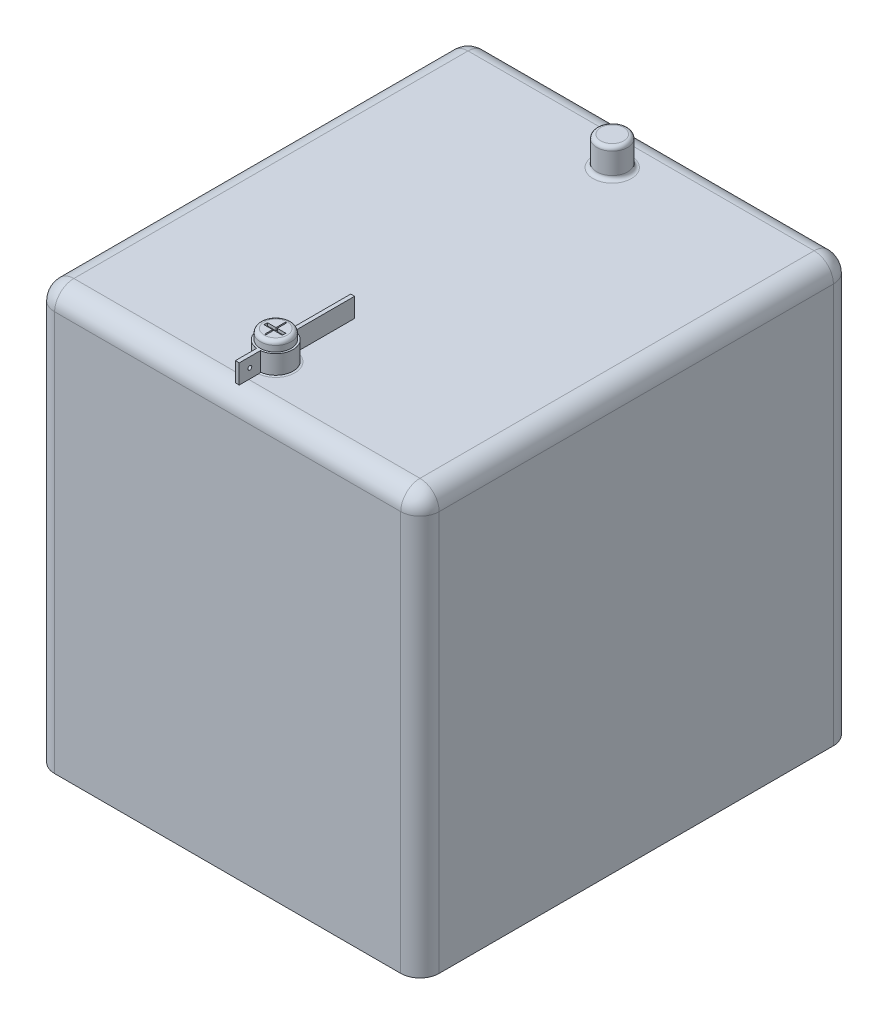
ISO-10303-21;
HEADER;
FILE_DESCRIPTION(('STEP AP214'),'2;1');
FILE_NAME('part.step','',(''),(''),'','','');
FILE_SCHEMA(('AUTOMOTIVE_DESIGN { 1 0 10303 214 1 1 1 1 }'));
ENDSEC;
DATA;
#1=APPLICATION_CONTEXT('core data for automotive mechanical design processes');
#2=APPLICATION_PROTOCOL_DEFINITION('international standard','automotive_design',2000,#1);
#3=PRODUCT_CONTEXT('',#1,'mechanical');
#4=PRODUCT('Part','Part','',(#3));
#5=PRODUCT_RELATED_PRODUCT_CATEGORY('part','',(#4));
#6=PRODUCT_DEFINITION_FORMATION('','',#4);
#7=PRODUCT_DEFINITION_CONTEXT('part definition',#1,'design');
#8=PRODUCT_DEFINITION('design','',#6,#7);
#9=PRODUCT_DEFINITION_SHAPE('','',#8);
#10=(LENGTH_UNIT() NAMED_UNIT(*) SI_UNIT(.MILLI.,.METRE.));
#11=(NAMED_UNIT(*) PLANE_ANGLE_UNIT() SI_UNIT($,.RADIAN.));
#12=(NAMED_UNIT(*) SI_UNIT($,.STERADIAN.) SOLID_ANGLE_UNIT());
#13=UNCERTAINTY_MEASURE_WITH_UNIT(LENGTH_MEASURE(1.E-05),#10,'distance_accuracy_value','');
#14=(GEOMETRIC_REPRESENTATION_CONTEXT(3) GLOBAL_UNCERTAINTY_ASSIGNED_CONTEXT((#13)) GLOBAL_UNIT_ASSIGNED_CONTEXT((#10,
#11,#12)) REPRESENTATION_CONTEXT('',''));
#15=CARTESIAN_POINT('',(0.,0.,0.));
#16=DIRECTION('',(0.,0.,1.));
#17=DIRECTION('',(1.,0.,0.));
#18=AXIS2_PLACEMENT_3D('',#15,#16,#17);
#19=CARTESIAN_POINT('',(-35.,111.,87.5));
#20=DIRECTION('',(0.,-1.,0.));
#21=DIRECTION('',(1.,0.,0.));
#22=AXIS2_PLACEMENT_3D('',#19,#20,#21);
#23=TOROIDAL_SURFACE('',#22,10.,2.);
#24=CARTESIAN_POINT('',(-36.,109.156871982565,96.6691777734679));
#25=CARTESIAN_POINT('',(-36.,109.200558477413,96.5648732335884));
#26=CARTESIAN_POINT('',(-36.,109.253053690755,96.4641705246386));
#27=CARTESIAN_POINT('',(-36.,109.374224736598,96.2729044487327));
#28=CARTESIAN_POINT('',(-36.,109.442919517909,96.1823531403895));
#29=CARTESIAN_POINT('',(-36.,109.594545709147,96.0140983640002));
#30=CARTESIAN_POINT('',(-36.,109.677473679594,95.9363918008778));
#31=CARTESIAN_POINT('',(-36.,109.855229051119,95.79610074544));
#32=CARTESIAN_POINT('',(-36.,109.950053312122,95.7335122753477));
#33=CARTESIAN_POINT('',(-36.,110.148495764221,95.6255249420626));
#34=CARTESIAN_POINT('',(-36.,110.252073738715,95.5800521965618));
#35=CARTESIAN_POINT('',(-36.,110.465431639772,95.5072763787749));
#36=CARTESIAN_POINT('',(-36.,110.575211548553,95.4799732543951));
#37=CARTESIAN_POINT('',(-36.,110.797047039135,95.4444896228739));
#38=CARTESIAN_POINT('',(-36.,110.90908190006,95.436179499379));
#39=CARTESIAN_POINT('',(-36.,111.132948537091,95.438550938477));
#40=CARTESIAN_POINT('',(-36.,111.24478031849,95.4492319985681));
#41=CARTESIAN_POINT('',(-36.,111.464710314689,95.4892002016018));
#42=CARTESIAN_POINT('',(-36.,111.572818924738,95.5184302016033));
#43=CARTESIAN_POINT('',(-36.,111.782616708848,95.594572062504));
#44=CARTESIAN_POINT('',(-36.,111.884305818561,95.6414841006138));
#45=CARTESIAN_POINT('',(-36.,112.078721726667,95.7517789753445));
#46=CARTESIAN_POINT('',(-36.,112.171420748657,95.8152107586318));
#47=CARTESIAN_POINT('',(-36.,112.344946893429,95.9566390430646));
#48=CARTESIAN_POINT('',(-36.,112.425773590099,96.0346360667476));
#49=CARTESIAN_POINT('',(-36.,112.573843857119,96.2035451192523));
#50=CARTESIAN_POINT('',(-36.,112.640991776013,96.2945409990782));
#51=CARTESIAN_POINT('',(-36.,112.75916734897,96.4864589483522));
#52=CARTESIAN_POINT('',(-36.,112.810194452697,96.5873813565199));
#53=CARTESIAN_POINT('',(-36.,112.894983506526,96.7969487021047));
#54=CARTESIAN_POINT('',(-36.,112.928639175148,96.9056366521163));
#55=CARTESIAN_POINT('',(-36.,112.977275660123,97.1271144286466));
#56=CARTESIAN_POINT('',(-36.,112.992256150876,97.2399043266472));
#57=CARTESIAN_POINT('',(-36.,113.003123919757,97.4666736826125));
#58=CARTESIAN_POINT('',(-36.,112.998965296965,97.5806553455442));
#59=CARTESIAN_POINT('',(-36.,112.971544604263,97.8062983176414));
#60=CARTESIAN_POINT('',(-36.,112.948282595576,97.9179596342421));
#61=CARTESIAN_POINT('',(-36.,112.883330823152,98.1356214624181));
#62=CARTESIAN_POINT('',(-36.,112.841666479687,98.2416295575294));
#63=CARTESIAN_POINT('',(-36.,112.741068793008,98.4451092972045));
#64=CARTESIAN_POINT('',(-36.,112.682135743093,98.5425810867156));
#65=CARTESIAN_POINT('',(-36.,112.548896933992,98.7258420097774));
#66=CARTESIAN_POINT('',(-36.,112.474647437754,98.8116720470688));
#67=CARTESIAN_POINT('',(-36.,112.312739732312,98.9695850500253));
#68=CARTESIAN_POINT('',(-36.,112.225081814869,99.0416683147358));
#69=CARTESIAN_POINT('',(-36.,112.039229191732,99.1697339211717));
#70=CARTESIAN_POINT('',(-36.,111.941078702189,99.2257804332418));
#71=CARTESIAN_POINT('',(-36.,111.73673897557,99.3205388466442));
#72=CARTESIAN_POINT('',(-36.,111.630549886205,99.3592510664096));
#73=CARTESIAN_POINT('',(-36.,111.413512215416,99.4181220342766));
#74=CARTESIAN_POINT('',(-36.,111.302679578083,99.4383395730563));
#75=CARTESIAN_POINT('',(-36.,111.07919329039,99.4598480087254));
#76=CARTESIAN_POINT('',(-36.,110.966539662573,99.4611391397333));
#77=CARTESIAN_POINT('',(-36.,110.742796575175,99.4447707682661));
#78=CARTESIAN_POINT('',(-36.,110.631704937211,99.4271410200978));
#79=CARTESIAN_POINT('',(-36.,110.414056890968,99.3734868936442));
#80=CARTESIAN_POINT('',(-36.,110.307500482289,99.337462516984));
#81=CARTESIAN_POINT('',(-36.,110.101902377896,99.2480414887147));
#82=CARTESIAN_POINT('',(-36.,110.002863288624,99.1946388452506));
#83=CARTESIAN_POINT('',(-36.,109.815130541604,99.0719986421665));
#84=CARTESIAN_POINT('',(-36.,109.72643699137,99.0027609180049));
#85=CARTESIAN_POINT('',(-36.,109.5616958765,98.850260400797));
#86=CARTESIAN_POINT('',(-36.,109.485676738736,98.766966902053));
#87=CARTESIAN_POINT('',(-36.,109.348644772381,98.5888421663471));
#88=CARTESIAN_POINT('',(-36.,109.287631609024,98.494011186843));
#89=CARTESIAN_POINT('',(-36.,109.182106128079,98.2951500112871));
#90=CARTESIAN_POINT('',(-36.,109.137652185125,98.1910888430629));
#91=CARTESIAN_POINT('',(-36.,109.066755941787,97.9769712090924));
#92=CARTESIAN_POINT('',(-36.,109.040318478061,97.8669131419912));
#93=CARTESIAN_POINT('',(-36.,109.00610199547,97.6434316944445));
#94=CARTESIAN_POINT('',(-36.,108.998408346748,97.5299952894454));
#95=CARTESIAN_POINT('',(-36.,109.002134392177,97.3035290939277));
#96=CARTESIAN_POINT('',(-36.,109.013531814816,97.1904989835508));
#97=CARTESIAN_POINT('',(-36.,109.047376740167,97.0090077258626));
#98=CARTESIAN_POINT('',(-36.,109.064214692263,96.9394514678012));
#99=CARTESIAN_POINT('',(-36.,109.105152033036,96.8025094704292));
#100=CARTESIAN_POINT('',(-36.,109.129251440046,96.7351237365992));
#101=CARTESIAN_POINT('',(-36.,109.156871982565,96.6691777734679));
#102=B_SPLINE_CURVE_WITH_KNOTS('',3,(#24,#25,#26,#27,#28,#29,#30,#31,#32,#33,#34,#35,#36,#37,
#38,#39,#40,#41,#42,#43,#44,#45,#46,#47,#48,#49,#50,#51,#52,#53,#54,#55,#56,#57,#58,#59,#60,#61,
#62,#63,#64,#65,#66,#67,#68,#69,#70,#71,#72,#73,#74,#75,#76,#77,#78,#79,#80,#81,#82,#83,#84,#85,
#86,#87,#88,#89,#90,#91,#92,#93,#94,#95,#96,#97,#98,#99,#100,#101),.UNSPECIFIED.,.T.,.F.,(4,2,2,
2,2,2,2,2,2,2,2,2,2,2,2,2,2,2,2,2,2,2,2,2,2,2,2,2,2,2,2,2,2,2,2,2,2,2,4),(0.,0.338992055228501,
0.678382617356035,1.01769128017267,1.35691056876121,1.69464830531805,2.03238507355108,
2.36781001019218,2.70322607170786,3.03761381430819,3.37200490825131,3.70739827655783,
4.04280367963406,4.38047952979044,4.71816690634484,5.0578965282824,5.39763207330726,
5.73818282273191,6.0787324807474,6.41881318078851,6.75888810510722,7.0977353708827,
7.43657526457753,7.77403971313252,8.11149796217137,8.44787973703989,8.78425735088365,
9.12010676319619,9.45595614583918,9.79192144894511,10.1278902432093,10.464602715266,
10.801307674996,11.1391886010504,11.4771601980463,11.8166682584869,12.1557805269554,
12.3701058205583,12.5844316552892),.UNSPECIFIED.);
#103=CARTESIAN_POINT('',(-36.,109.,97.4498743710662));
#104=VERTEX_POINT('',#103);
#105=CARTESIAN_POINT('',(-36.,109.267949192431,96.4442719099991));
#106=VERTEX_POINT('',#105);
#107=EDGE_CURVE('E53',#104,#106,#102,.T.);
#108=ORIENTED_EDGE('',*,*,#107,.T.);
#109=CARTESIAN_POINT('',(-35.,109.267949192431,87.5));
#110=DIRECTION('',(0.,-1.,0.));
#111=DIRECTION('',(1.,0.,0.));
#112=AXIS2_PLACEMENT_3D('',#109,#110,#111);
#113=CIRCLE('',#112,8.99999999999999);
#114=CARTESIAN_POINT('',(-36.,109.267949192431,78.5557280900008));
#115=VERTEX_POINT('',#114);
#116=EDGE_CURVE('E58',#106,#115,#113,.T.);
#117=ORIENTED_EDGE('',*,*,#116,.T.);
#118=CARTESIAN_POINT('',(-36.,109.014576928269,77.7923996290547));
#119=CARTESIAN_POINT('',(-36.,109.000994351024,77.6798831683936));
#120=CARTESIAN_POINT('',(-36.,108.996886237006,77.5661402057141));
#121=CARTESIAN_POINT('',(-36.,109.007804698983,77.3394813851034));
#122=CARTESIAN_POINT('',(-36.,109.022854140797,77.2265666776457));
#123=CARTESIAN_POINT('',(-36.,109.07170782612,77.0048986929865));
#124=CARTESIAN_POINT('',(-36.,109.105505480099,76.8961439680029));
#125=CARTESIAN_POINT('',(-36.,109.190916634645,76.6859039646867));
#126=CARTESIAN_POINT('',(-36.,109.242525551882,76.5844168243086));
#127=CARTESIAN_POINT('',(-36.,109.361979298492,76.3918253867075));
#128=CARTESIAN_POINT('',(-36.,109.429785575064,76.3006971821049));
#129=CARTESIAN_POINT('',(-36.,109.579795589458,76.1311742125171));
#130=CARTESIAN_POINT('',(-36.,109.661999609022,76.052779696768));
#131=CARTESIAN_POINT('',(-36.,109.838105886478,75.9112947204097));
#132=CARTESIAN_POINT('',(-36.,109.931958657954,75.8481426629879));
#133=CARTESIAN_POINT('',(-36.,110.128963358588,75.7385558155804));
#134=CARTESIAN_POINT('',(-36.,110.232115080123,75.6921206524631));
#135=CARTESIAN_POINT('',(-36.,110.444405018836,75.6174462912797));
#136=CARTESIAN_POINT('',(-36.,110.553521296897,75.58914471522));
#137=CARTESIAN_POINT('',(-36.,110.774959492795,75.5513025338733));
#138=CARTESIAN_POINT('',(-36.,110.887281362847,75.541761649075));
#139=CARTESIAN_POINT('',(-36.,111.111707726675,75.5417169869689));
#140=CARTESIAN_POINT('',(-36.,111.223812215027,75.551175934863));
#141=CARTESIAN_POINT('',(-36.,111.444840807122,75.5887825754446));
#142=CARTESIAN_POINT('',(-36.,111.55376492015,75.6169302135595));
#143=CARTESIAN_POINT('',(-36.,111.765337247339,75.6910992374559));
#144=CARTESIAN_POINT('',(-36.,111.867985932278,75.7371192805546));
#145=CARTESIAN_POINT('',(-36.,112.064119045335,75.8457094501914));
#146=CARTESIAN_POINT('',(-36.,112.157603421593,75.9082796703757));
#147=CARTESIAN_POINT('',(-36.,112.332943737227,76.0483062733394));
#148=CARTESIAN_POINT('',(-36.,112.414778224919,76.1257895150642));
#149=CARTESIAN_POINT('',(-36.,112.564329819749,76.2933543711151));
#150=CARTESIAN_POINT('',(-36.,112.632046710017,76.3834361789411));
#151=CARTESIAN_POINT('',(-36.,112.751688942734,76.5739602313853));
#152=CARTESIAN_POINT('',(-36.,112.803560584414,76.6744361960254));
#153=CARTESIAN_POINT('',(-36.,112.889776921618,76.8826450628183));
#154=CARTESIAN_POINT('',(-36.,112.924121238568,76.9903781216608));
#155=CARTESIAN_POINT('',(-36.,112.974454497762,77.2105125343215));
#156=CARTESIAN_POINT('',(-36.,112.990368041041,77.3229311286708));
#157=CARTESIAN_POINT('',(-36.,113.003166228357,77.5488465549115));
#158=CARTESIAN_POINT('',(-36.,113.00005044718,77.6623434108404));
#159=CARTESIAN_POINT('',(-36.,112.97485065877,77.887607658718));
#160=CARTESIAN_POINT('',(-36.,112.95270149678,77.9993677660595));
#161=CARTESIAN_POINT('',(-36.,112.889975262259,78.2175925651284));
#162=CARTESIAN_POINT('',(-36.,112.84939795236,78.3240571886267));
#163=CARTESIAN_POINT('',(-36.,112.750897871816,78.5287688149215));
#164=CARTESIAN_POINT('',(-36.,112.692957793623,78.6270074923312));
#165=CARTESIAN_POINT('',(-36.,112.561362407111,78.8123281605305));
#166=CARTESIAN_POINT('',(-36.,112.48770723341,78.8994102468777));
#167=CARTESIAN_POINT('',(-36.,112.326980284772,79.0596531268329));
#168=CARTESIAN_POINT('',(-36.,112.239948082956,79.1328536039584));
#169=CARTESIAN_POINT('',(-36.,112.054762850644,79.2634924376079));
#170=CARTESIAN_POINT('',(-36.,111.956610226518,79.3209313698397));
#171=CARTESIAN_POINT('',(-36.,111.752638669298,79.4180168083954));
#172=CARTESIAN_POINT('',(-36.,111.646872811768,79.457774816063));
#173=CARTESIAN_POINT('',(-36.,111.430142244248,79.5188374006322));
#174=CARTESIAN_POINT('',(-36.,111.319177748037,79.5401427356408));
#175=CARTESIAN_POINT('',(-36.,111.095977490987,79.5635763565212));
#176=CARTESIAN_POINT('',(-36.,110.983754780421,79.5658290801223));
#177=CARTESIAN_POINT('',(-36.,110.76053230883,79.5514164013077));
#178=CARTESIAN_POINT('',(-36.,110.649532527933,79.5347513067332));
#179=CARTESIAN_POINT('',(-36.,110.432146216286,79.4830607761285));
#180=CARTESIAN_POINT('',(-36.,110.32575039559,79.4480743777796));
#181=CARTESIAN_POINT('',(-36.,110.120313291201,79.3608042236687));
#182=CARTESIAN_POINT('',(-36.,110.021271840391,79.3085208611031));
#183=CARTESIAN_POINT('',(-36.,109.832935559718,79.1879568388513));
#184=CARTESIAN_POINT('',(-36.,109.743678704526,79.1196168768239));
#185=CARTESIAN_POINT('',(-36.,109.577781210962,78.9689973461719));
#186=CARTESIAN_POINT('',(-36.,109.501144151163,78.8867138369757));
#187=CARTESIAN_POINT('',(-36.,109.362095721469,78.7099125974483));
#188=CARTESIAN_POINT('',(-36.,109.299794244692,78.615308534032));
#189=CARTESIAN_POINT('',(-36.,109.191920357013,78.4171008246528));
#190=CARTESIAN_POINT('',(-36.,109.146328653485,78.3135077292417));
#191=CARTESIAN_POINT('',(-36.,109.086613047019,78.1397410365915));
#192=CARTESIAN_POINT('',(-36.,109.06708697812,78.071372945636));
#193=CARTESIAN_POINT('',(-36.,109.035325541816,77.9329637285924));
#194=CARTESIAN_POINT('',(-36.,109.0230902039,77.8629225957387));
#195=CARTESIAN_POINT('',(-36.,109.014576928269,77.7923996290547));
#196=B_SPLINE_CURVE_WITH_KNOTS('',3,(#118,#119,#120,#121,#122,#123,#124,#125,#126,#127,#128,
#129,#130,#131,#132,#133,#134,#135,#136,#137,#138,#139,#140,#141,#142,#143,#144,#145,#146,#147,
#148,#149,#150,#151,#152,#153,#154,#155,#156,#157,#158,#159,#160,#161,#162,#163,#164,#165,#166,
#167,#168,#169,#170,#171,#172,#173,#174,#175,#176,#177,#178,#179,#180,#181,#182,#183,#184,#185,
#186,#187,#188,#189,#190,#191,#192,#193,#194,#195),.UNSPECIFIED.,.T.,.F.,(4,2,2,2,2,2,2,2,2,2,2,
2,2,2,2,2,2,2,2,2,2,2,2,2,2,2,2,2,2,2,2,2,2,2,2,2,2,2,4),(0.,0.339741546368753,
0.679888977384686,1.01991693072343,1.35985745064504,1.69899677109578,2.03814272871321,
2.3758943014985,2.71363833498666,3.05021423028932,3.3867851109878,3.72269633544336,
4.05860657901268,4.39449159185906,4.73037850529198,5.06687612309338,5.40337890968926,
5.74100979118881,6.07864796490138,6.41766256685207,6.75668474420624,7.09687210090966,
7.43706383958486,7.77759582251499,8.11812488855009,8.45766530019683,8.7971933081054,
9.13454868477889,9.4718902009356,9.80702673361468,10.1421578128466,10.4765777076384,
10.810990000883,11.1466573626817,11.4824197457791,11.8206760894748,12.1585406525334,
12.3714826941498,12.5844255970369),.UNSPECIFIED.);
#197=CARTESIAN_POINT('',(-36.,109.,77.5501256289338));
#198=VERTEX_POINT('',#197);
#199=EDGE_CURVE('E348',#115,#198,#196,.T.);
#200=ORIENTED_EDGE('',*,*,#199,.T.);
#201=CARTESIAN_POINT('',(-35.,109.,87.5));
#202=DIRECTION('',(0.,-1.,0.));
#203=DIRECTION('',(1.,0.,0.));
#204=AXIS2_PLACEMENT_3D('',#201,#202,#203);
#205=CIRCLE('',#204,10.);
#206=EDGE_CURVE('E468',#104,#198,#205,.T.);
#207=ORIENTED_EDGE('',*,*,#206,.F.);
#208=EDGE_LOOP('',(#108,#117,#200,#207));
#209=FACE_BOUND('',#208,.T.);
#210=ADVANCED_FACE('F34',(#209),#23,.F.);
#211=CARTESIAN_POINT('',(-33.4588960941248,122.5,92.9436510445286));
#212=DIRECTION('',(0.,0.,1.));
#213=DIRECTION('',(1.,0.,0.));
#214=AXIS2_PLACEMENT_3D('',#211,#212,#213);
#215=PLANE('',#214);
#216=DIRECTION('',(0.,1.,0.));
#217=VECTOR('',#216,1.);
#218=CARTESIAN_POINT('',(-34.6717808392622,122.5,92.9436510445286));
#219=LINE('',#218,#217);
#220=CARTESIAN_POINT('',(-34.6717808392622,122.5,92.9436510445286));
#221=VERTEX_POINT('',#220);
#222=CARTESIAN_POINT('',(-34.6717808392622,124.,92.9436510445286));
#223=VERTEX_POINT('',#222);
#224=EDGE_CURVE('E305',#221,#223,#219,.T.);
#225=ORIENTED_EDGE('',*,*,#224,.F.);
#226=DIRECTION('',(1.,0.,0.));
#227=VECTOR('',#226,1.);
#228=CARTESIAN_POINT('',(-33.4588960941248,122.5,92.9436510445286));
#229=LINE('',#228,#227);
#230=CARTESIAN_POINT('',(-35.3282191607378,122.5,92.9436510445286));
#231=VERTEX_POINT('',#230);
#232=EDGE_CURVE('E515',#231,#221,#229,.T.);
#233=ORIENTED_EDGE('',*,*,#232,.F.);
#234=DIRECTION('',(0.,1.,0.));
#235=VECTOR('',#234,1.);
#236=CARTESIAN_POINT('',(-35.3282191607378,122.5,92.9436510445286));
#237=LINE('',#236,#235);
#238=CARTESIAN_POINT('',(-35.3282191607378,124.,92.9436510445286));
#239=VERTEX_POINT('',#238);
#240=EDGE_CURVE('E538',#231,#239,#237,.T.);
#241=ORIENTED_EDGE('',*,*,#240,.T.);
#242=DIRECTION('',(1.,0.,0.));
#243=VECTOR('',#242,1.);
#244=CARTESIAN_POINT('',(-33.4588960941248,124.,92.9436510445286));
#245=LINE('',#244,#243);
#246=EDGE_CURVE('E498',#239,#223,#245,.T.);
#247=ORIENTED_EDGE('',*,*,#246,.T.);
#248=EDGE_LOOP('',(#225,#233,#241,#247));
#249=FACE_BOUND('',#248,.T.);
#250=ADVANCED_FACE('F429',(#249),#215,.F.);
#251=CARTESIAN_POINT('',(-28.8063586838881,122.5,88.8726808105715));
#252=DIRECTION('',(0.,0.,1.));
#253=DIRECTION('',(1.,0.,0.));
#254=AXIS2_PLACEMENT_3D('',#251,#252,#253);
#255=PLANE('',#254);
#256=DIRECTION('',(0.,1.,0.));
#257=VECTOR('',#256,1.);
#258=CARTESIAN_POINT('',(-30.2269459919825,122.5,88.8726808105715));
#259=LINE('',#258,#257);
#260=CARTESIAN_POINT('',(-30.2269459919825,122.5,88.8726808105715));
#261=VERTEX_POINT('',#260);
#262=CARTESIAN_POINT('',(-30.2269459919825,124.,88.8726808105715));
#263=VERTEX_POINT('',#262);
#264=EDGE_CURVE('E312',#261,#263,#259,.T.);
#265=ORIENTED_EDGE('',*,*,#264,.F.);
#266=DIRECTION('',(1.,0.,0.));
#267=VECTOR('',#266,1.);
#268=CARTESIAN_POINT('',(-28.8063586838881,122.5,88.8726808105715));
#269=LINE('',#268,#267);
#270=CARTESIAN_POINT('',(-34.6717808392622,122.5,88.8726808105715));
#271=VERTEX_POINT('',#270);
#272=EDGE_CURVE('E495',#271,#261,#269,.T.);
#273=ORIENTED_EDGE('',*,*,#272,.F.);
#274=DIRECTION('',(0.,1.,0.));
#275=VECTOR('',#274,1.);
#276=CARTESIAN_POINT('',(-34.6717808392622,122.5,88.8726808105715));
#277=LINE('',#276,#275);
#278=CARTESIAN_POINT('',(-34.6717808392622,124.,88.8726808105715));
#279=VERTEX_POINT('',#278);
#280=EDGE_CURVE('E309',#271,#279,#277,.T.);
#281=ORIENTED_EDGE('',*,*,#280,.T.);
#282=DIRECTION('',(1.,0.,0.));
#283=VECTOR('',#282,1.);
#284=CARTESIAN_POINT('',(-28.8063586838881,124.,88.8726808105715));
#285=LINE('',#284,#283);
#286=EDGE_CURVE('E494',#279,#263,#285,.T.);
#287=ORIENTED_EDGE('',*,*,#286,.T.);
#288=EDGE_LOOP('',(#265,#273,#281,#287));
#289=FACE_BOUND('',#288,.T.);
#290=ADVANCED_FACE('F434',(#289),#255,.F.);
#291=CARTESIAN_POINT('',(-65.,109.,112.5));
#292=DIRECTION('',(0.,-1.,0.));
#293=DIRECTION('',(1.,0.,0.));
#294=AXIS2_PLACEMENT_3D('',#291,#292,#293);
#295=PLANE('',#294);
#296=DIRECTION('',(-1.,0.,0.));
#297=VECTOR('',#296,1.);
#298=CARTESIAN_POINT('',(-65.,109.,-102.5));
#299=LINE('',#298,#297);
#300=CARTESIAN_POINT('',(55.,109.,-102.5));
#301=VERTEX_POINT('',#300);
#302=CARTESIAN_POINT('',(-125.,109.,-102.5));
#303=VERTEX_POINT('',#302);
#304=EDGE_CURVE('E565',#301,#303,#299,.T.);
#305=ORIENTED_EDGE('',*,*,#304,.T.);
#306=DIRECTION('',(0.,0.,-1.));
#307=VECTOR('',#306,1.);
#308=CARTESIAN_POINT('',(-125.,109.,112.5));
#309=LINE('',#308,#307);
#310=CARTESIAN_POINT('',(-125.,109.,102.5));
#311=VERTEX_POINT('',#310);
#312=EDGE_CURVE('E324',#311,#303,#309,.T.);
#313=ORIENTED_EDGE('',*,*,#312,.F.);
#314=DIRECTION('',(-1.,0.,0.));
#315=VECTOR('',#314,1.);
#316=CARTESIAN_POINT('',(65.,109.,102.5));
#317=LINE('',#316,#315);
#318=CARTESIAN_POINT('',(-36.,109.,102.5));
#319=VERTEX_POINT('',#318);
#320=EDGE_CURVE('E562',#311,#319,#317,.F.);
#321=ORIENTED_EDGE('',*,*,#320,.T.);
#322=DIRECTION('',(0.,0.,-1.));
#323=VECTOR('',#322,1.);
#324=CARTESIAN_POINT('',(-36.,109.,96.4442719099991));
#325=LINE('',#324,#323);
#326=EDGE_CURVE('E772',#319,#104,#325,.T.);
#327=ORIENTED_EDGE('',*,*,#326,.T.);
#328=ORIENTED_EDGE('',*,*,#206,.T.);
#329=DIRECTION('',(0.,0.,-1.));
#330=VECTOR('',#329,1.);
#331=CARTESIAN_POINT('',(-36.,109.,47.5));
#332=LINE('',#331,#330);
#333=CARTESIAN_POINT('',(-36.,109.,47.5));
#334=VERTEX_POINT('',#333);
#335=EDGE_CURVE('E274',#198,#334,#332,.T.);
#336=ORIENTED_EDGE('',*,*,#335,.T.);
#337=DIRECTION('',(-1.,0.,0.));
#338=VECTOR('',#337,1.);
#339=CARTESIAN_POINT('',(-35.,109.,47.5));
#340=LINE('',#339,#338);
#341=CARTESIAN_POINT('',(-34.,109.,47.5));
#342=VERTEX_POINT('',#341);
#343=EDGE_CURVE('E480',#342,#334,#340,.T.);
#344=ORIENTED_EDGE('',*,*,#343,.F.);
#345=DIRECTION('',(0.,0.,-1.));
#346=VECTOR('',#345,1.);
#347=CARTESIAN_POINT('',(-34.,109.,47.5));
#348=LINE('',#347,#346);
#349=CARTESIAN_POINT('',(-34.,109.,77.5501256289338));
#350=VERTEX_POINT('',#349);
#351=EDGE_CURVE('E467',#350,#342,#348,.T.);
#352=ORIENTED_EDGE('',*,*,#351,.F.);
#353=CARTESIAN_POINT('',(-34.,109.,97.4498743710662));
#354=VERTEX_POINT('',#353);
#355=EDGE_CURVE('E455',#350,#354,#205,.T.);
#356=ORIENTED_EDGE('',*,*,#355,.T.);
#357=DIRECTION('',(0.,0.,-1.));
#358=VECTOR('',#357,1.);
#359=CARTESIAN_POINT('',(-34.,109.,96.4442719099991));
#360=LINE('',#359,#358);
#361=CARTESIAN_POINT('',(-34.,109.,102.5));
#362=VERTEX_POINT('',#361);
#363=EDGE_CURVE('E464',#362,#354,#360,.T.);
#364=ORIENTED_EDGE('',*,*,#363,.F.);
#365=CARTESIAN_POINT('',(55.,109.,102.5));
#366=VERTEX_POINT('',#365);
#367=EDGE_CURVE('E561',#362,#366,#317,.F.);
#368=ORIENTED_EDGE('',*,*,#367,.T.);
#369=DIRECTION('',(0.,0.,-1.));
#370=VECTOR('',#369,1.);
#371=CARTESIAN_POINT('',(55.,109.,112.5));
#372=LINE('',#371,#370);
#373=EDGE_CURVE('E567',#366,#301,#372,.T.);
#374=ORIENTED_EDGE('',*,*,#373,.T.);
#375=EDGE_LOOP('',(#305,#313,#321,#327,#328,#336,#344,#352,#356,#364,#368,#374));
#376=FACE_BOUND('',#375,.T.);
#377=CARTESIAN_POINT('',(-35.,109.,-87.5));
#378=DIRECTION('',(0.,-1.,0.));
#379=DIRECTION('',(1.,0.,0.));
#380=AXIS2_PLACEMENT_3D('',#377,#378,#379);
#381=CIRCLE('',#380,10.);
#382=CARTESIAN_POINT('',(-25.,109.,-87.5));
#383=VERTEX_POINT('',#382);
#384=EDGE_CURVE('E469',#383,#383,#381,.T.);
#385=ORIENTED_EDGE('',*,*,#384,.T.);
#386=EDGE_LOOP('',(#385));
#387=FACE_BOUND('',#386,.T.);
#388=ADVANCED_FACE('F450',(#376,#387),#295,.F.);
#389=CARTESIAN_POINT('',(-35.,124.,87.5));
#390=DIRECTION('',(0.,-1.,0.));
#391=DIRECTION('',(1.,0.,0.));
#392=AXIS2_PLACEMENT_3D('',#389,#390,#391);
#393=CYLINDRICAL_SURFACE('',#392,8.);
#394=CARTESIAN_POINT('',(-35.,122.,87.5));
#395=DIRECTION('',(0.,1.,0.));
#396=DIRECTION('',(-1.,0.,0.));
#397=AXIS2_PLACEMENT_3D('',#394,#395,#396);
#398=CIRCLE('',#397,8.);
#399=CARTESIAN_POINT('',(-43.,122.,87.5));
#400=VERTEX_POINT('',#399);
#401=EDGE_CURVE('E617',#400,#400,#398,.F.);
#402=ORIENTED_EDGE('',*,*,#401,.T.);
#403=EDGE_LOOP('',(#402));
#404=FACE_BOUND('',#403,.T.);
#405=CARTESIAN_POINT('',(-35.,119.,87.5));
#406=DIRECTION('',(0.,-1.,0.));
#407=DIRECTION('',(-1.,0.,0.));
#408=AXIS2_PLACEMENT_3D('',#405,#406,#407);
#409=CIRCLE('',#408,7.99999999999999);
#410=CARTESIAN_POINT('',(-43.,119.,87.5));
#411=VERTEX_POINT('',#410);
#412=EDGE_CURVE('E264',#411,#411,#409,.T.);
#413=ORIENTED_EDGE('',*,*,#412,.F.);
#414=EDGE_LOOP('',(#413));
#415=FACE_BOUND('',#414,.T.);
#416=ADVANCED_FACE('F441',(#404,#415),#393,.T.);
#417=CARTESIAN_POINT('',(-34.,109.156871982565,96.6691777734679));
#418=CARTESIAN_POINT('',(-34.,109.200558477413,96.5648732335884));
#419=CARTESIAN_POINT('',(-34.,109.253053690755,96.4641705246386));
#420=CARTESIAN_POINT('',(-34.,109.374224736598,96.2729044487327));
#421=CARTESIAN_POINT('',(-34.,109.442919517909,96.1823531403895));
#422=CARTESIAN_POINT('',(-34.,109.594545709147,96.0140983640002));
#423=CARTESIAN_POINT('',(-34.,109.677473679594,95.9363918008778));
#424=CARTESIAN_POINT('',(-34.,109.855229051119,95.79610074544));
#425=CARTESIAN_POINT('',(-34.,109.950053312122,95.7335122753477));
#426=CARTESIAN_POINT('',(-34.,110.148495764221,95.6255249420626));
#427=CARTESIAN_POINT('',(-34.,110.252073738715,95.5800521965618));
#428=CARTESIAN_POINT('',(-34.,110.465431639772,95.5072763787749));
#429=CARTESIAN_POINT('',(-34.,110.575211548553,95.4799732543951));
#430=CARTESIAN_POINT('',(-34.,110.797047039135,95.4444896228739));
#431=CARTESIAN_POINT('',(-34.,110.90908190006,95.436179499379));
#432=CARTESIAN_POINT('',(-34.,111.132948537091,95.438550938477));
#433=CARTESIAN_POINT('',(-34.,111.24478031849,95.4492319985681));
#434=CARTESIAN_POINT('',(-34.,111.464710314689,95.4892002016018));
#435=CARTESIAN_POINT('',(-34.,111.572818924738,95.5184302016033));
#436=CARTESIAN_POINT('',(-34.,111.782616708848,95.594572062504));
#437=CARTESIAN_POINT('',(-34.,111.884305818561,95.6414841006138));
#438=CARTESIAN_POINT('',(-34.,112.078721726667,95.7517789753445));
#439=CARTESIAN_POINT('',(-34.,112.171420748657,95.8152107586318));
#440=CARTESIAN_POINT('',(-34.,112.344946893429,95.9566390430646));
#441=CARTESIAN_POINT('',(-34.,112.425773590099,96.0346360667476));
#442=CARTESIAN_POINT('',(-34.,112.573843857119,96.2035451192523));
#443=CARTESIAN_POINT('',(-34.,112.640991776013,96.2945409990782));
#444=CARTESIAN_POINT('',(-34.,112.75916734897,96.4864589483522));
#445=CARTESIAN_POINT('',(-34.,112.810194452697,96.5873813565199));
#446=CARTESIAN_POINT('',(-34.,112.894983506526,96.7969487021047));
#447=CARTESIAN_POINT('',(-34.,112.928639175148,96.9056366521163));
#448=CARTESIAN_POINT('',(-34.,112.977275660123,97.1271144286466));
#449=CARTESIAN_POINT('',(-34.,112.992256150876,97.2399043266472));
#450=CARTESIAN_POINT('',(-34.,113.003123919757,97.4666736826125));
#451=CARTESIAN_POINT('',(-34.,112.998965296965,97.5806553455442));
#452=CARTESIAN_POINT('',(-34.,112.971544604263,97.8062983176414));
#453=CARTESIAN_POINT('',(-34.,112.948282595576,97.9179596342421));
#454=CARTESIAN_POINT('',(-34.,112.883330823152,98.1356214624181));
#455=CARTESIAN_POINT('',(-34.,112.841666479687,98.2416295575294));
#456=CARTESIAN_POINT('',(-34.,112.741068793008,98.4451092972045));
#457=CARTESIAN_POINT('',(-34.,112.682135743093,98.5425810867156));
#458=CARTESIAN_POINT('',(-34.,112.548896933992,98.7258420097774));
#459=CARTESIAN_POINT('',(-34.,112.474647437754,98.8116720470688));
#460=CARTESIAN_POINT('',(-34.,112.312739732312,98.9695850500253));
#461=CARTESIAN_POINT('',(-34.,112.225081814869,99.0416683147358));
#462=CARTESIAN_POINT('',(-34.,112.039229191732,99.1697339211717));
#463=CARTESIAN_POINT('',(-34.,111.941078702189,99.2257804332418));
#464=CARTESIAN_POINT('',(-34.,111.73673897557,99.3205388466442));
#465=CARTESIAN_POINT('',(-34.,111.630549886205,99.3592510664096));
#466=CARTESIAN_POINT('',(-34.,111.413512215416,99.4181220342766));
#467=CARTESIAN_POINT('',(-34.,111.302679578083,99.4383395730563));
#468=CARTESIAN_POINT('',(-34.,111.07919329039,99.4598480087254));
#469=CARTESIAN_POINT('',(-34.,110.966539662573,99.4611391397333));
#470=CARTESIAN_POINT('',(-34.,110.742796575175,99.4447707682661));
#471=CARTESIAN_POINT('',(-34.,110.631704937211,99.4271410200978));
#472=CARTESIAN_POINT('',(-34.,110.414056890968,99.3734868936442));
#473=CARTESIAN_POINT('',(-34.,110.307500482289,99.337462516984));
#474=CARTESIAN_POINT('',(-34.,110.101902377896,99.2480414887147));
#475=CARTESIAN_POINT('',(-34.,110.002863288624,99.1946388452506));
#476=CARTESIAN_POINT('',(-34.,109.815130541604,99.0719986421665));
#477=CARTESIAN_POINT('',(-34.,109.72643699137,99.0027609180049));
#478=CARTESIAN_POINT('',(-34.,109.5616958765,98.850260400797));
#479=CARTESIAN_POINT('',(-34.,109.485676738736,98.766966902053));
#480=CARTESIAN_POINT('',(-34.,109.348644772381,98.5888421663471));
#481=CARTESIAN_POINT('',(-34.,109.287631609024,98.494011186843));
#482=CARTESIAN_POINT('',(-34.,109.182106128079,98.2951500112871));
#483=CARTESIAN_POINT('',(-34.,109.137652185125,98.1910888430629));
#484=CARTESIAN_POINT('',(-34.,109.066755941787,97.9769712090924));
#485=CARTESIAN_POINT('',(-34.,109.040318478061,97.8669131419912));
#486=CARTESIAN_POINT('',(-34.,109.00610199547,97.6434316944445));
#487=CARTESIAN_POINT('',(-34.,108.998408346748,97.5299952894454));
#488=CARTESIAN_POINT('',(-34.,109.002134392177,97.3035290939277));
#489=CARTESIAN_POINT('',(-34.,109.013531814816,97.1904989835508));
#490=CARTESIAN_POINT('',(-34.,109.047376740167,97.0090077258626));
#491=CARTESIAN_POINT('',(-34.,109.064214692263,96.9394514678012));
#492=CARTESIAN_POINT('',(-34.,109.105152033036,96.8025094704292));
#493=CARTESIAN_POINT('',(-34.,109.129251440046,96.7351237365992));
#494=CARTESIAN_POINT('',(-34.,109.156871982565,96.6691777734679));
#495=B_SPLINE_CURVE_WITH_KNOTS('',3,(#417,#418,#419,#420,#421,#422,#423,#424,#425,#426,#427,
#428,#429,#430,#431,#432,#433,#434,#435,#436,#437,#438,#439,#440,#441,#442,#443,#444,#445,#446,
#447,#448,#449,#450,#451,#452,#453,#454,#455,#456,#457,#458,#459,#460,#461,#462,#463,#464,#465,
#466,#467,#468,#469,#470,#471,#472,#473,#474,#475,#476,#477,#478,#479,#480,#481,#482,#483,#484,
#485,#486,#487,#488,#489,#490,#491,#492,#493,#494),.UNSPECIFIED.,.T.,.F.,(4,2,2,2,2,2,2,2,2,2,2,
2,2,2,2,2,2,2,2,2,2,2,2,2,2,2,2,2,2,2,2,2,2,2,2,2,2,2,4),(0.,0.338992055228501,
0.678382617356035,1.01769128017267,1.35691056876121,1.69464830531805,2.03238507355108,
2.36781001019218,2.70322607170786,3.03761381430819,3.37200490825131,3.70739827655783,
4.04280367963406,4.38047952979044,4.71816690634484,5.0578965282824,5.39763207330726,
5.73818282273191,6.0787324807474,6.41881318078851,6.75888810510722,7.0977353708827,
7.43657526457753,7.77403971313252,8.11149796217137,8.44787973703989,8.78425735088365,
9.12010676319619,9.45595614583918,9.79192144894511,10.1278902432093,10.464602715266,
10.801307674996,11.1391886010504,11.4771601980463,11.8166682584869,12.1557805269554,
12.3701058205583,12.5844316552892),.UNSPECIFIED.);
#496=CARTESIAN_POINT('',(-34.,109.267949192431,96.4442719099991));
#497=VERTEX_POINT('',#496);
#498=EDGE_CURVE('E11',#354,#497,#495,.T.);
#499=ORIENTED_EDGE('',*,*,#498,.F.);
#500=ORIENTED_EDGE('',*,*,#355,.F.);
#501=CARTESIAN_POINT('',(-34.,109.014576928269,77.7923996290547));
#502=CARTESIAN_POINT('',(-34.,109.000994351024,77.6798831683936));
#503=CARTESIAN_POINT('',(-34.,108.996886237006,77.5661402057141));
#504=CARTESIAN_POINT('',(-34.,109.007804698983,77.3394813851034));
#505=CARTESIAN_POINT('',(-34.,109.022854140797,77.2265666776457));
#506=CARTESIAN_POINT('',(-34.,109.07170782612,77.0048986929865));
#507=CARTESIAN_POINT('',(-34.,109.105505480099,76.8961439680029));
#508=CARTESIAN_POINT('',(-34.,109.190916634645,76.6859039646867));
#509=CARTESIAN_POINT('',(-34.,109.242525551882,76.5844168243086));
#510=CARTESIAN_POINT('',(-34.,109.361979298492,76.3918253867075));
#511=CARTESIAN_POINT('',(-34.,109.429785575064,76.3006971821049));
#512=CARTESIAN_POINT('',(-34.,109.579795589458,76.1311742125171));
#513=CARTESIAN_POINT('',(-34.,109.661999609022,76.052779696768));
#514=CARTESIAN_POINT('',(-34.,109.838105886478,75.9112947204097));
#515=CARTESIAN_POINT('',(-34.,109.931958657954,75.8481426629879));
#516=CARTESIAN_POINT('',(-34.,110.128963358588,75.7385558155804));
#517=CARTESIAN_POINT('',(-34.,110.232115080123,75.6921206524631));
#518=CARTESIAN_POINT('',(-34.,110.444405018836,75.6174462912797));
#519=CARTESIAN_POINT('',(-34.,110.553521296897,75.58914471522));
#520=CARTESIAN_POINT('',(-34.,110.774959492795,75.5513025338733));
#521=CARTESIAN_POINT('',(-34.,110.887281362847,75.541761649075));
#522=CARTESIAN_POINT('',(-34.,111.111707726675,75.5417169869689));
#523=CARTESIAN_POINT('',(-34.,111.223812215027,75.551175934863));
#524=CARTESIAN_POINT('',(-34.,111.444840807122,75.5887825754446));
#525=CARTESIAN_POINT('',(-34.,111.55376492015,75.6169302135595));
#526=CARTESIAN_POINT('',(-34.,111.765337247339,75.6910992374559));
#527=CARTESIAN_POINT('',(-34.,111.867985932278,75.7371192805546));
#528=CARTESIAN_POINT('',(-34.,112.064119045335,75.8457094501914));
#529=CARTESIAN_POINT('',(-34.,112.157603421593,75.9082796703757));
#530=CARTESIAN_POINT('',(-34.,112.332943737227,76.0483062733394));
#531=CARTESIAN_POINT('',(-34.,112.414778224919,76.1257895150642));
#532=CARTESIAN_POINT('',(-34.,112.564329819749,76.2933543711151));
#533=CARTESIAN_POINT('',(-34.,112.632046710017,76.3834361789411));
#534=CARTESIAN_POINT('',(-34.,112.751688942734,76.5739602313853));
#535=CARTESIAN_POINT('',(-34.,112.803560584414,76.6744361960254));
#536=CARTESIAN_POINT('',(-34.,112.889776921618,76.8826450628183));
#537=CARTESIAN_POINT('',(-34.,112.924121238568,76.9903781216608));
#538=CARTESIAN_POINT('',(-34.,112.974454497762,77.2105125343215));
#539=CARTESIAN_POINT('',(-34.,112.990368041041,77.3229311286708));
#540=CARTESIAN_POINT('',(-34.,113.003166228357,77.5488465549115));
#541=CARTESIAN_POINT('',(-34.,113.00005044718,77.6623434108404));
#542=CARTESIAN_POINT('',(-34.,112.97485065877,77.887607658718));
#543=CARTESIAN_POINT('',(-34.,112.95270149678,77.9993677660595));
#544=CARTESIAN_POINT('',(-34.,112.889975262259,78.2175925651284));
#545=CARTESIAN_POINT('',(-34.,112.84939795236,78.3240571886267));
#546=CARTESIAN_POINT('',(-34.,112.750897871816,78.5287688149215));
#547=CARTESIAN_POINT('',(-34.,112.692957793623,78.6270074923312));
#548=CARTESIAN_POINT('',(-34.,112.561362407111,78.8123281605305));
#549=CARTESIAN_POINT('',(-34.,112.48770723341,78.8994102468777));
#550=CARTESIAN_POINT('',(-34.,112.326980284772,79.0596531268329));
#551=CARTESIAN_POINT('',(-34.,112.239948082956,79.1328536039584));
#552=CARTESIAN_POINT('',(-34.,112.054762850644,79.2634924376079));
#553=CARTESIAN_POINT('',(-34.,111.956610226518,79.3209313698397));
#554=CARTESIAN_POINT('',(-34.,111.752638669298,79.4180168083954));
#555=CARTESIAN_POINT('',(-34.,111.646872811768,79.457774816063));
#556=CARTESIAN_POINT('',(-34.,111.430142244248,79.5188374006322));
#557=CARTESIAN_POINT('',(-34.,111.319177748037,79.5401427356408));
#558=CARTESIAN_POINT('',(-34.,111.095977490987,79.5635763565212));
#559=CARTESIAN_POINT('',(-34.,110.983754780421,79.5658290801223));
#560=CARTESIAN_POINT('',(-34.,110.76053230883,79.5514164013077));
#561=CARTESIAN_POINT('',(-34.,110.649532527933,79.5347513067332));
#562=CARTESIAN_POINT('',(-34.,110.432146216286,79.4830607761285));
#563=CARTESIAN_POINT('',(-34.,110.32575039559,79.4480743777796));
#564=CARTESIAN_POINT('',(-34.,110.120313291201,79.3608042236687));
#565=CARTESIAN_POINT('',(-34.,110.021271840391,79.3085208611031));
#566=CARTESIAN_POINT('',(-34.,109.832935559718,79.1879568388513));
#567=CARTESIAN_POINT('',(-34.,109.743678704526,79.1196168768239));
#568=CARTESIAN_POINT('',(-34.,109.577781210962,78.9689973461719));
#569=CARTESIAN_POINT('',(-34.,109.501144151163,78.8867138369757));
#570=CARTESIAN_POINT('',(-34.,109.362095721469,78.7099125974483));
#571=CARTESIAN_POINT('',(-34.,109.299794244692,78.615308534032));
#572=CARTESIAN_POINT('',(-34.,109.191920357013,78.4171008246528));
#573=CARTESIAN_POINT('',(-34.,109.146328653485,78.3135077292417));
#574=CARTESIAN_POINT('',(-34.,109.086613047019,78.1397410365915));
#575=CARTESIAN_POINT('',(-34.,109.06708697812,78.071372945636));
#576=CARTESIAN_POINT('',(-34.,109.035325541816,77.9329637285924));
#577=CARTESIAN_POINT('',(-34.,109.0230902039,77.8629225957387));
#578=CARTESIAN_POINT('',(-34.,109.014576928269,77.7923996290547));
#579=B_SPLINE_CURVE_WITH_KNOTS('',3,(#501,#502,#503,#504,#505,#506,#507,#508,#509,#510,#511,
#512,#513,#514,#515,#516,#517,#518,#519,#520,#521,#522,#523,#524,#525,#526,#527,#528,#529,#530,
#531,#532,#533,#534,#535,#536,#537,#538,#539,#540,#541,#542,#543,#544,#545,#546,#547,#548,#549,
#550,#551,#552,#553,#554,#555,#556,#557,#558,#559,#560,#561,#562,#563,#564,#565,#566,#567,#568,
#569,#570,#571,#572,#573,#574,#575,#576,#577,#578),.UNSPECIFIED.,.T.,.F.,(4,2,2,2,2,2,2,2,2,2,2,
2,2,2,2,2,2,2,2,2,2,2,2,2,2,2,2,2,2,2,2,2,2,2,2,2,2,2,4),(0.,0.339741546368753,
0.679888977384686,1.01991693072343,1.35985745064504,1.69899677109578,2.03814272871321,
2.3758943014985,2.71363833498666,3.05021423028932,3.3867851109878,3.72269633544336,
4.05860657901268,4.39449159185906,4.73037850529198,5.06687612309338,5.40337890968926,
5.74100979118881,6.07864796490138,6.41766256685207,6.75668474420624,7.09687210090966,
7.43706383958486,7.77759582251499,8.11812488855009,8.45766530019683,8.7971933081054,
9.13454868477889,9.4718902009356,9.80702673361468,10.1421578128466,10.4765777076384,
10.810990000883,11.1466573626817,11.4824197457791,11.8206760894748,12.1585406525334,
12.3714826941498,12.5844255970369),.UNSPECIFIED.);
#580=CARTESIAN_POINT('',(-34.,109.267949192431,78.5557280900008));
#581=VERTEX_POINT('',#580);
#582=EDGE_CURVE('E622',#581,#350,#579,.T.);
#583=ORIENTED_EDGE('',*,*,#582,.F.);
#584=CARTESIAN_POINT('',(-35.,109.267949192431,87.5));
#585=DIRECTION('',(0.,1.,0.));
#586=DIRECTION('',(-1.,0.,0.));
#587=AXIS2_PLACEMENT_3D('',#584,#585,#586);
#588=CIRCLE('',#587,8.99999999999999);
#589=EDGE_CURVE('E46',#497,#581,#588,.T.);
#590=ORIENTED_EDGE('',*,*,#589,.F.);
#591=EDGE_LOOP('',(#499,#500,#583,#590));
#592=FACE_BOUND('',#591,.T.);
#593=ADVANCED_FACE('F430',(#592),#23,.F.);
#594=CARTESIAN_POINT('',(-65.,-109.,112.5));
#595=DIRECTION('',(0.,1.,0.));
#596=DIRECTION('',(-1.,0.,0.));
#597=AXIS2_PLACEMENT_3D('',#594,#595,#596);
#598=PLANE('',#597);
#599=CARTESIAN_POINT('',(55.,-109.,102.5));
#600=DIRECTION('',(0.,1.,0.));
#601=DIRECTION('',(-1.,0.,0.));
#602=AXIS2_PLACEMENT_3D('',#599,#600,#601);
#603=CIRCLE('',#602,10.);
#604=CARTESIAN_POINT('',(65.,-109.,102.5));
#605=VERTEX_POINT('',#604);
#606=CARTESIAN_POINT('',(55.,-109.,112.5));
#607=VERTEX_POINT('',#606);
#608=EDGE_CURVE('E588',#605,#607,#603,.F.);
#609=ORIENTED_EDGE('',*,*,#608,.T.);
#610=DIRECTION('',(1.,0.,0.));
#611=VECTOR('',#610,1.);
#612=CARTESIAN_POINT('',(-65.,-109.,112.5));
#613=LINE('',#612,#611);
#614=CARTESIAN_POINT('',(-125.,-109.,112.5));
#615=VERTEX_POINT('',#614);
#616=EDGE_CURVE('E553',#615,#607,#613,.T.);
#617=ORIENTED_EDGE('',*,*,#616,.F.);
#618=CARTESIAN_POINT('',(-125.,-109.,102.5));
#619=DIRECTION('',(0.,-1.,0.));
#620=DIRECTION('',(1.,0.,0.));
#621=AXIS2_PLACEMENT_3D('',#618,#619,#620);
#622=CIRCLE('',#621,10.);
#623=CARTESIAN_POINT('',(-135.,-109.,102.5));
#624=VERTEX_POINT('',#623);
#625=EDGE_CURVE('E345',#624,#615,#622,.F.);
#626=ORIENTED_EDGE('',*,*,#625,.F.);
#627=DIRECTION('',(0.,0.,-1.));
#628=VECTOR('',#627,1.);
#629=CARTESIAN_POINT('',(-135.,-109.,112.5));
#630=LINE('',#629,#628);
#631=CARTESIAN_POINT('',(-135.,-109.,-102.5));
#632=VERTEX_POINT('',#631);
#633=EDGE_CURVE('E321',#624,#632,#630,.T.);
#634=ORIENTED_EDGE('',*,*,#633,.T.);
#635=CARTESIAN_POINT('',(-125.,-109.,-102.5));
#636=DIRECTION('',(0.,-1.,0.));
#637=DIRECTION('',(1.,0.,0.));
#638=AXIS2_PLACEMENT_3D('',#635,#636,#637);
#639=CIRCLE('',#638,10.);
#640=CARTESIAN_POINT('',(-125.,-109.,-112.5));
#641=VERTEX_POINT('',#640);
#642=EDGE_CURVE('E342',#641,#632,#639,.F.);
#643=ORIENTED_EDGE('',*,*,#642,.F.);
#644=DIRECTION('',(1.,0.,0.));
#645=VECTOR('',#644,1.);
#646=CARTESIAN_POINT('',(-65.,-109.,-112.5));
#647=LINE('',#646,#645);
#648=CARTESIAN_POINT('',(55.,-109.,-112.5));
#649=VERTEX_POINT('',#648);
#650=EDGE_CURVE('E556',#641,#649,#647,.T.);
#651=ORIENTED_EDGE('',*,*,#650,.T.);
#652=CARTESIAN_POINT('',(55.,-109.,-102.5));
#653=DIRECTION('',(0.,1.,0.));
#654=DIRECTION('',(-1.,0.,0.));
#655=AXIS2_PLACEMENT_3D('',#652,#653,#654);
#656=CIRCLE('',#655,10.);
#657=CARTESIAN_POINT('',(65.,-109.,-102.5));
#658=VERTEX_POINT('',#657);
#659=EDGE_CURVE('E586',#649,#658,#656,.F.);
#660=ORIENTED_EDGE('',*,*,#659,.T.);
#661=DIRECTION('',(0.,0.,-1.));
#662=VECTOR('',#661,1.);
#663=CARTESIAN_POINT('',(65.,-109.,112.5));
#664=LINE('',#663,#662);
#665=EDGE_CURVE('E555',#605,#658,#664,.T.);
#666=ORIENTED_EDGE('',*,*,#665,.F.);
#667=EDGE_LOOP('',(#609,#617,#626,#634,#643,#651,#660,#666));
#668=FACE_BOUND('',#667,.T.);
#669=ADVANCED_FACE('F440',(#668),#598,.F.);
#670=CARTESIAN_POINT('',(65.,109.,112.5));
#671=DIRECTION('',(-1.,0.,0.));
#672=DIRECTION('',(0.,-1.,0.));
#673=AXIS2_PLACEMENT_3D('',#670,#671,#672);
#674=PLANE('',#673);
#675=DIRECTION('',(0.,0.,-1.));
#676=VECTOR('',#675,1.);
#677=CARTESIAN_POINT('',(65.,99.,112.5));
#678=LINE('',#677,#676);
#679=CARTESIAN_POINT('',(65.,99.,-102.5));
#680=VERTEX_POINT('',#679);
#681=CARTESIAN_POINT('',(65.,99.,102.5));
#682=VERTEX_POINT('',#681);
#683=EDGE_CURVE('E572',#680,#682,#678,.F.);
#684=ORIENTED_EDGE('',*,*,#683,.T.);
#685=DIRECTION('',(0.,1.,0.));
#686=VECTOR('',#685,1.);
#687=CARTESIAN_POINT('',(65.,-109.,102.5));
#688=LINE('',#687,#686);
#689=EDGE_CURVE('E575',#682,#605,#688,.F.);
#690=ORIENTED_EDGE('',*,*,#689,.T.);
#691=ORIENTED_EDGE('',*,*,#665,.T.);
#692=DIRECTION('',(0.,1.,0.));
#693=VECTOR('',#692,1.);
#694=CARTESIAN_POINT('',(65.,109.,-102.5));
#695=LINE('',#694,#693);
#696=EDGE_CURVE('E570',#658,#680,#695,.T.);
#697=ORIENTED_EDGE('',*,*,#696,.T.);
#698=EDGE_LOOP('',(#684,#690,#691,#697));
#699=FACE_BOUND('',#698,.T.);
#700=ADVANCED_FACE('F447',(#699),#674,.F.);
#701=CARTESIAN_POINT('',(-65.,109.,112.5));
#702=DIRECTION('',(0.,0.,1.));
#703=DIRECTION('',(1.,0.,0.));
#704=AXIS2_PLACEMENT_3D('',#701,#702,#703);
#705=PLANE('',#704);
#706=DIRECTION('',(-1.,0.,0.));
#707=VECTOR('',#706,1.);
#708=CARTESIAN_POINT('',(-65.,99.,112.5));
#709=LINE('',#708,#707);
#710=CARTESIAN_POINT('',(55.,99.,112.5));
#711=VERTEX_POINT('',#710);
#712=CARTESIAN_POINT('',(-125.,99.,112.5));
#713=VERTEX_POINT('',#712);
#714=EDGE_CURVE('E582',#711,#713,#709,.T.);
#715=ORIENTED_EDGE('',*,*,#714,.T.);
#716=DIRECTION('',(0.,1.,0.));
#717=VECTOR('',#716,1.);
#718=CARTESIAN_POINT('',(-125.,109.,112.5));
#719=LINE('',#718,#717);
#720=EDGE_CURVE('E339',#615,#713,#719,.T.);
#721=ORIENTED_EDGE('',*,*,#720,.F.);
#722=ORIENTED_EDGE('',*,*,#616,.T.);
#723=DIRECTION('',(0.,1.,0.));
#724=VECTOR('',#723,1.);
#725=CARTESIAN_POINT('',(55.,109.,112.5));
#726=LINE('',#725,#724);
#727=EDGE_CURVE('E584',#607,#711,#726,.T.);
#728=ORIENTED_EDGE('',*,*,#727,.T.);
#729=EDGE_LOOP('',(#715,#721,#722,#728));
#730=FACE_BOUND('',#729,.T.);
#731=ADVANCED_FACE('F693',(#730),#705,.T.);
#732=CARTESIAN_POINT('',(-65.,109.,-112.5));
#733=DIRECTION('',(0.,0.,1.));
#734=DIRECTION('',(1.,0.,0.));
#735=AXIS2_PLACEMENT_3D('',#732,#733,#734);
#736=PLANE('',#735);
#737=DIRECTION('',(-1.,0.,0.));
#738=VECTOR('',#737,1.);
#739=CARTESIAN_POINT('',(-65.,99.,-112.5));
#740=LINE('',#739,#738);
#741=CARTESIAN_POINT('',(-125.,99.,-112.5));
#742=VERTEX_POINT('',#741);
#743=CARTESIAN_POINT('',(55.,99.,-112.5));
#744=VERTEX_POINT('',#743);
#745=EDGE_CURVE('E577',#742,#744,#740,.F.);
#746=ORIENTED_EDGE('',*,*,#745,.T.);
#747=DIRECTION('',(0.,1.,0.));
#748=VECTOR('',#747,1.);
#749=CARTESIAN_POINT('',(55.,109.,-112.5));
#750=LINE('',#749,#748);
#751=EDGE_CURVE('E579',#744,#649,#750,.F.);
#752=ORIENTED_EDGE('',*,*,#751,.T.);
#753=ORIENTED_EDGE('',*,*,#650,.F.);
#754=DIRECTION('',(0.,1.,0.));
#755=VECTOR('',#754,1.);
#756=CARTESIAN_POINT('',(-125.,109.,-112.5));
#757=LINE('',#756,#755);
#758=EDGE_CURVE('E336',#742,#641,#757,.F.);
#759=ORIENTED_EDGE('',*,*,#758,.F.);
#760=EDGE_LOOP('',(#746,#752,#753,#759));
#761=FACE_BOUND('',#760,.T.);
#762=ADVANCED_FACE('F696',(#761),#736,.F.);
#763=CARTESIAN_POINT('',(55.,109.,102.5));
#764=DIRECTION('',(0.,-1.,0.));
#765=DIRECTION('',(1.,0.,0.));
#766=AXIS2_PLACEMENT_3D('',#763,#764,#765);
#767=CYLINDRICAL_SURFACE('',#766,10.);
#768=ORIENTED_EDGE('',*,*,#608,.F.);
#769=ORIENTED_EDGE('',*,*,#689,.F.);
#770=CARTESIAN_POINT('',(55.,99.,102.5));
#771=DIRECTION('',(0.,1.,0.));
#772=DIRECTION('',(0.,0.,1.));
#773=AXIS2_PLACEMENT_3D('',#770,#771,#772);
#774=CIRCLE('',#773,10.);
#775=EDGE_CURVE('E558',#711,#682,#774,.T.);
#776=ORIENTED_EDGE('',*,*,#775,.F.);
#777=ORIENTED_EDGE('',*,*,#727,.F.);
#778=EDGE_LOOP('',(#768,#769,#776,#777));
#779=FACE_BOUND('',#778,.T.);
#780=ADVANCED_FACE('F700',(#779),#767,.T.);
#781=CARTESIAN_POINT('',(-65.,99.,102.5));
#782=DIRECTION('',(1.,0.,0.));
#783=DIRECTION('',(0.,1.,0.));
#784=AXIS2_PLACEMENT_3D('',#781,#782,#783);
#785=CYLINDRICAL_SURFACE('',#784,10.);
#786=CARTESIAN_POINT('',(-125.,99.,102.5));
#787=DIRECTION('',(1.,0.,0.));
#788=DIRECTION('',(0.,0.,-1.));
#789=AXIS2_PLACEMENT_3D('',#786,#787,#788);
#790=CIRCLE('',#789,10.);
#791=EDGE_CURVE('E359',#311,#713,#790,.T.);
#792=ORIENTED_EDGE('',*,*,#791,.T.);
#793=ORIENTED_EDGE('',*,*,#714,.F.);
#794=CARTESIAN_POINT('',(55.,99.,102.5));
#795=DIRECTION('',(1.,0.,0.));
#796=DIRECTION('',(0.,0.,-1.));
#797=AXIS2_PLACEMENT_3D('',#794,#795,#796);
#798=CIRCLE('',#797,10.);
#799=EDGE_CURVE('E601',#366,#711,#798,.T.);
#800=ORIENTED_EDGE('',*,*,#799,.F.);
#801=ORIENTED_EDGE('',*,*,#367,.F.);
#802=DIRECTION('',(1.,0.,0.));
#803=VECTOR('',#802,1.);
#804=CARTESIAN_POINT('',(-65.,109.,102.5));
#805=LINE('',#804,#803);
#806=EDGE_CURVE('E492',#362,#319,#805,.F.);
#807=ORIENTED_EDGE('',*,*,#806,.T.);
#808=ORIENTED_EDGE('',*,*,#320,.F.);
#809=EDGE_LOOP('',(#792,#793,#800,#801,#807,#808));
#810=FACE_BOUND('',#809,.T.);
#811=ADVANCED_FACE('F725',(#810),#785,.T.);
#812=CARTESIAN_POINT('',(-65.,99.,-102.5));
#813=DIRECTION('',(-1.,0.,0.));
#814=DIRECTION('',(0.,-1.,0.));
#815=AXIS2_PLACEMENT_3D('',#812,#813,#814);
#816=CYLINDRICAL_SURFACE('',#815,10.);
#817=CARTESIAN_POINT('',(-125.,99.,-102.5));
#818=DIRECTION('',(1.,0.,0.));
#819=DIRECTION('',(0.,1.,0.));
#820=AXIS2_PLACEMENT_3D('',#817,#818,#819);
#821=CIRCLE('',#820,10.);
#822=EDGE_CURVE('E356',#742,#303,#821,.T.);
#823=ORIENTED_EDGE('',*,*,#822,.T.);
#824=ORIENTED_EDGE('',*,*,#304,.F.);
#825=CARTESIAN_POINT('',(55.,99.,-102.5));
#826=DIRECTION('',(1.,0.,0.));
#827=DIRECTION('',(0.,1.,0.));
#828=AXIS2_PLACEMENT_3D('',#825,#826,#827);
#829=CIRCLE('',#828,10.);
#830=EDGE_CURVE('E598',#744,#301,#829,.T.);
#831=ORIENTED_EDGE('',*,*,#830,.F.);
#832=ORIENTED_EDGE('',*,*,#745,.F.);
#833=EDGE_LOOP('',(#823,#824,#831,#832));
#834=FACE_BOUND('',#833,.T.);
#835=ADVANCED_FACE('F721',(#834),#816,.T.);
#836=CARTESIAN_POINT('',(55.,109.,-102.5));
#837=DIRECTION('',(0.,1.,0.));
#838=DIRECTION('',(-1.,0.,0.));
#839=AXIS2_PLACEMENT_3D('',#836,#837,#838);
#840=CYLINDRICAL_SURFACE('',#839,10.);
#841=ORIENTED_EDGE('',*,*,#659,.F.);
#842=ORIENTED_EDGE('',*,*,#751,.F.);
#843=CARTESIAN_POINT('',(55.,99.,-102.5));
#844=DIRECTION('',(0.,1.,0.));
#845=DIRECTION('',(0.,0.,1.));
#846=AXIS2_PLACEMENT_3D('',#843,#844,#845);
#847=CIRCLE('',#846,10.);
#848=EDGE_CURVE('E595',#680,#744,#847,.T.);
#849=ORIENTED_EDGE('',*,*,#848,.F.);
#850=ORIENTED_EDGE('',*,*,#696,.F.);
#851=EDGE_LOOP('',(#841,#842,#849,#850));
#852=FACE_BOUND('',#851,.T.);
#853=ADVANCED_FACE('F717',(#852),#840,.T.);
#854=CARTESIAN_POINT('',(55.,99.,102.5));
#855=DIRECTION('',(0.,0.,1.));
#856=DIRECTION('',(1.,0.,0.));
#857=AXIS2_PLACEMENT_3D('',#854,#855,#856);
#858=SPHERICAL_SURFACE('',#857,10.);
#859=ORIENTED_EDGE('',*,*,#799,.T.);
#860=ORIENTED_EDGE('',*,*,#775,.T.);
#861=CARTESIAN_POINT('',(55.,99.,102.5));
#862=DIRECTION('',(0.,0.,1.));
#863=DIRECTION('',(1.,0.,0.));
#864=AXIS2_PLACEMENT_3D('',#861,#862,#863);
#865=CIRCLE('',#864,10.);
#866=EDGE_CURVE('E593',#366,#682,#865,.F.);
#867=ORIENTED_EDGE('',*,*,#866,.F.);
#868=EDGE_LOOP('',(#859,#860,#867));
#869=FACE_BOUND('',#868,.T.);
#870=ADVANCED_FACE('F713',(#869),#858,.T.);
#871=CARTESIAN_POINT('',(55.,99.,-102.5));
#872=DIRECTION('',(0.,0.,1.));
#873=DIRECTION('',(1.,0.,0.));
#874=AXIS2_PLACEMENT_3D('',#871,#872,#873);
#875=SPHERICAL_SURFACE('',#874,10.);
#876=ORIENTED_EDGE('',*,*,#848,.T.);
#877=ORIENTED_EDGE('',*,*,#830,.T.);
#878=CARTESIAN_POINT('',(55.,99.,-102.5));
#879=DIRECTION('',(0.,0.,-1.));
#880=DIRECTION('',(-1.,0.,0.));
#881=AXIS2_PLACEMENT_3D('',#878,#879,#880);
#882=CIRCLE('',#881,10.);
#883=EDGE_CURVE('E540',#680,#301,#882,.F.);
#884=ORIENTED_EDGE('',*,*,#883,.F.);
#885=EDGE_LOOP('',(#876,#877,#884));
#886=FACE_BOUND('',#885,.T.);
#887=ADVANCED_FACE('F709',(#886),#875,.T.);
#888=CARTESIAN_POINT('',(55.,99.,112.5));
#889=DIRECTION('',(0.,0.,-1.));
#890=DIRECTION('',(-1.,0.,0.));
#891=AXIS2_PLACEMENT_3D('',#888,#889,#890);
#892=CYLINDRICAL_SURFACE('',#891,10.);
#893=ORIENTED_EDGE('',*,*,#866,.T.);
#894=ORIENTED_EDGE('',*,*,#683,.F.);
#895=ORIENTED_EDGE('',*,*,#883,.T.);
#896=ORIENTED_EDGE('',*,*,#373,.F.);
#897=EDGE_LOOP('',(#893,#894,#895,#896));
#898=FACE_BOUND('',#897,.T.);
#899=ADVANCED_FACE('F690',(#898),#892,.T.);
#900=CARTESIAN_POINT('',(-35.,124.,87.5));
#901=DIRECTION('',(0.,1.,0.));
#902=DIRECTION('',(-1.,0.,0.));
#903=AXIS2_PLACEMENT_3D('',#900,#901,#902);
#904=PLANE('',#903);
#905=CARTESIAN_POINT('',(-35.,124.,87.5));
#906=DIRECTION('',(0.,1.,0.));
#907=DIRECTION('',(-1.,0.,0.));
#908=AXIS2_PLACEMENT_3D('',#905,#906,#907);
#909=CIRCLE('',#908,6.);
#910=CARTESIAN_POINT('',(-41.,124.,87.5));
#911=VERTEX_POINT('',#910);
#912=EDGE_CURVE('E614',#911,#911,#909,.T.);
#913=ORIENTED_EDGE('',*,*,#912,.T.);
#914=EDGE_LOOP('',(#913));
#915=FACE_BOUND('',#914,.T.);
#916=ORIENTED_EDGE('',*,*,#286,.F.);
#917=DIRECTION('',(0.,0.,1.));
#918=VECTOR('',#917,1.);
#919=CARTESIAN_POINT('',(-34.6717808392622,124.,92.9436510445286));
#920=LINE('',#919,#918);
#921=EDGE_CURVE('E294',#279,#223,#920,.T.);
#922=ORIENTED_EDGE('',*,*,#921,.T.);
#923=ORIENTED_EDGE('',*,*,#246,.F.);
#924=DIRECTION('',(0.,0.,1.));
#925=VECTOR('',#924,1.);
#926=CARTESIAN_POINT('',(-35.3282191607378,124.,92.9436510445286));
#927=LINE('',#926,#925);
#928=CARTESIAN_POINT('',(-35.3282191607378,124.,88.8726808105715));
#929=VERTEX_POINT('',#928);
#930=EDGE_CURVE('E534',#929,#239,#927,.T.);
#931=ORIENTED_EDGE('',*,*,#930,.F.);
#932=DIRECTION('',(1.,0.,0.));
#933=VECTOR('',#932,1.);
#934=CARTESIAN_POINT('',(-35.3282191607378,124.,88.8726808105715));
#935=LINE('',#934,#933);
#936=CARTESIAN_POINT('',(-39.7730540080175,124.,88.8726808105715));
#937=VERTEX_POINT('',#936);
#938=EDGE_CURVE('E532',#937,#929,#935,.T.);
#939=ORIENTED_EDGE('',*,*,#938,.F.);
#940=DIRECTION('',(0.,0.,1.));
#941=VECTOR('',#940,1.);
#942=CARTESIAN_POINT('',(-39.7730540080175,124.,88.8726808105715));
#943=LINE('',#942,#941);
#944=CARTESIAN_POINT('',(-39.7730540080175,124.,87.0448982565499));
#945=VERTEX_POINT('',#944);
#946=EDGE_CURVE('E529',#945,#937,#943,.T.);
#947=ORIENTED_EDGE('',*,*,#946,.F.);
#948=DIRECTION('',(-1.,0.,0.));
#949=VECTOR('',#948,1.);
#950=CARTESIAN_POINT('',(-35.3282191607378,124.,87.0448982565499));
#951=LINE('',#950,#949);
#952=CARTESIAN_POINT('',(-35.3282191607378,124.,87.0448982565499));
#953=VERTEX_POINT('',#952);
#954=EDGE_CURVE('E527',#953,#945,#951,.T.);
#955=ORIENTED_EDGE('',*,*,#954,.F.);
#956=DIRECTION('',(0.,0.,1.));
#957=VECTOR('',#956,1.);
#958=CARTESIAN_POINT('',(-35.3282191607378,124.,87.0448982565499));
#959=LINE('',#958,#957);
#960=CARTESIAN_POINT('',(-35.3282191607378,124.,82.1431177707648));
#961=VERTEX_POINT('',#960);
#962=EDGE_CURVE('E524',#961,#953,#959,.T.);
#963=ORIENTED_EDGE('',*,*,#962,.F.);
#964=DIRECTION('',(-1.,0.,0.));
#965=VECTOR('',#964,1.);
#966=CARTESIAN_POINT('',(-33.4588960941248,124.,82.1431177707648));
#967=LINE('',#966,#965);
#968=CARTESIAN_POINT('',(-34.6717808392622,124.,82.1431177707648));
#969=VERTEX_POINT('',#968);
#970=EDGE_CURVE('E522',#969,#961,#967,.T.);
#971=ORIENTED_EDGE('',*,*,#970,.F.);
#972=DIRECTION('',(0.,0.,1.));
#973=VECTOR('',#972,1.);
#974=CARTESIAN_POINT('',(-34.6717808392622,124.,87.0448982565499));
#975=LINE('',#974,#973);
#976=CARTESIAN_POINT('',(-34.6717808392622,124.,87.0448982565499));
#977=VERTEX_POINT('',#976);
#978=EDGE_CURVE('E280',#969,#977,#975,.T.);
#979=ORIENTED_EDGE('',*,*,#978,.T.);
#980=DIRECTION('',(-1.,0.,0.));
#981=VECTOR('',#980,1.);
#982=CARTESIAN_POINT('',(-28.8063586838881,124.,87.0448982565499));
#983=LINE('',#982,#981);
#984=CARTESIAN_POINT('',(-30.2269459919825,124.,87.0448982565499));
#985=VERTEX_POINT('',#984);
#986=EDGE_CURVE('E520',#985,#977,#983,.T.);
#987=ORIENTED_EDGE('',*,*,#986,.F.);
#988=DIRECTION('',(0.,0.,1.));
#989=VECTOR('',#988,1.);
#990=CARTESIAN_POINT('',(-30.2269459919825,124.,88.8726808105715));
#991=LINE('',#990,#989);
#992=EDGE_CURVE('E284',#985,#263,#991,.T.);
#993=ORIENTED_EDGE('',*,*,#992,.T.);
#994=EDGE_LOOP('',(#916,#922,#923,#931,#939,#947,#955,#963,#971,#979,#987,#993));
#995=FACE_BOUND('',#994,.T.);
#996=ADVANCED_FACE('F687',(#915,#995),#904,.T.);
#997=CARTESIAN_POINT('',(-35.,124.,-87.5));
#998=DIRECTION('',(0.,-1.,0.));
#999=DIRECTION('',(1.,0.,0.));
#1000=AXIS2_PLACEMENT_3D('',#997,#998,#999);
#1001=CYLINDRICAL_SURFACE('',#1000,8.);
#1002=CARTESIAN_POINT('',(-35.,122.,-87.5));
#1003=DIRECTION('',(0.,-1.,0.));
#1004=DIRECTION('',(1.,0.,0.));
#1005=AXIS2_PLACEMENT_3D('',#1002,#1003,#1004);
#1006=CIRCLE('',#1005,8.);
#1007=CARTESIAN_POINT('',(-27.,122.,-87.5));
#1008=VERTEX_POINT('',#1007);
#1009=EDGE_CURVE('E611',#1008,#1008,#1006,.T.);
#1010=ORIENTED_EDGE('',*,*,#1009,.T.);
#1011=EDGE_LOOP('',(#1010));
#1012=FACE_BOUND('',#1011,.T.);
#1013=CARTESIAN_POINT('',(-35.,111.,-87.5));
#1014=DIRECTION('',(0.,-1.,0.));
#1015=DIRECTION('',(1.,0.,0.));
#1016=AXIS2_PLACEMENT_3D('',#1013,#1014,#1015);
#1017=CIRCLE('',#1016,8.);
#1018=CARTESIAN_POINT('',(-27.,111.,-87.5));
#1019=VERTEX_POINT('',#1018);
#1020=EDGE_CURVE('E608',#1019,#1019,#1017,.F.);
#1021=ORIENTED_EDGE('',*,*,#1020,.T.);
#1022=EDGE_LOOP('',(#1021));
#1023=FACE_BOUND('',#1022,.T.);
#1024=ADVANCED_FACE('F683',(#1012,#1023),#1001,.T.);
#1025=CARTESIAN_POINT('',(-35.,124.,-87.5));
#1026=DIRECTION('',(0.,-1.,0.));
#1027=DIRECTION('',(1.,0.,0.));
#1028=AXIS2_PLACEMENT_3D('',#1025,#1026,#1027);
#1029=PLANE('',#1028);
#1030=CARTESIAN_POINT('',(-35.,124.,-87.5));
#1031=DIRECTION('',(0.,-1.,0.));
#1032=DIRECTION('',(1.,0.,0.));
#1033=AXIS2_PLACEMENT_3D('',#1030,#1031,#1032);
#1034=CIRCLE('',#1033,6.);
#1035=CARTESIAN_POINT('',(-29.,124.,-87.5));
#1036=VERTEX_POINT('',#1035);
#1037=EDGE_CURVE('E591',#1036,#1036,#1034,.F.);
#1038=ORIENTED_EDGE('',*,*,#1037,.T.);
#1039=EDGE_LOOP('',(#1038));
#1040=FACE_BOUND('',#1039,.T.);
#1041=ADVANCED_FACE('F679',(#1040),#1029,.F.);
#1042=CARTESIAN_POINT('',(-35.,122.,-87.5));
#1043=DIRECTION('',(0.,-1.,0.));
#1044=DIRECTION('',(1.,0.,0.));
#1045=AXIS2_PLACEMENT_3D('',#1042,#1043,#1044);
#1046=TOROIDAL_SURFACE('',#1045,6.,2.);
#1047=ORIENTED_EDGE('',*,*,#1009,.F.);
#1048=EDGE_LOOP('',(#1047));
#1049=FACE_BOUND('',#1048,.T.);
#1050=ORIENTED_EDGE('',*,*,#1037,.F.);
#1051=EDGE_LOOP('',(#1050));
#1052=FACE_BOUND('',#1051,.T.);
#1053=ADVANCED_FACE('F682',(#1049,#1052),#1046,.T.);
#1054=CARTESIAN_POINT('',(-35.,122.,87.5));
#1055=DIRECTION('',(0.,1.,0.));
#1056=DIRECTION('',(-1.,0.,0.));
#1057=AXIS2_PLACEMENT_3D('',#1054,#1055,#1056);
#1058=TOROIDAL_SURFACE('',#1057,6.,2.);
#1059=ORIENTED_EDGE('',*,*,#912,.F.);
#1060=EDGE_LOOP('',(#1059));
#1061=FACE_BOUND('',#1060,.T.);
#1062=ORIENTED_EDGE('',*,*,#401,.F.);
#1063=EDGE_LOOP('',(#1062));
#1064=FACE_BOUND('',#1063,.T.);
#1065=ADVANCED_FACE('F734',(#1061,#1064),#1058,.T.);
#1066=CARTESIAN_POINT('',(-35.,111.,-87.5));
#1067=DIRECTION('',(0.,-1.,0.));
#1068=DIRECTION('',(1.,0.,0.));
#1069=AXIS2_PLACEMENT_3D('',#1066,#1067,#1068);
#1070=TOROIDAL_SURFACE('',#1069,10.,2.);
#1071=ORIENTED_EDGE('',*,*,#384,.F.);
#1072=EDGE_LOOP('',(#1071));
#1073=FACE_BOUND('',#1072,.T.);
#1074=ORIENTED_EDGE('',*,*,#1020,.F.);
#1075=EDGE_LOOP('',(#1074));
#1076=FACE_BOUND('',#1075,.T.);
#1077=ADVANCED_FACE('F36',(#1073,#1076),#1070,.F.);
#1078=CARTESIAN_POINT('',(-35.3282191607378,122.5,92.9436510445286));
#1079=DIRECTION('',(-1.,0.,0.));
#1080=DIRECTION('',(0.,-1.,0.));
#1081=AXIS2_PLACEMENT_3D('',#1078,#1079,#1080);
#1082=PLANE('',#1081);
#1083=ORIENTED_EDGE('',*,*,#930,.T.);
#1084=ORIENTED_EDGE('',*,*,#240,.F.);
#1085=DIRECTION('',(0.,0.,1.));
#1086=VECTOR('',#1085,1.);
#1087=CARTESIAN_POINT('',(-35.3282191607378,122.5,92.9436510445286));
#1088=LINE('',#1087,#1086);
#1089=CARTESIAN_POINT('',(-35.3282191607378,122.5,88.8726808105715));
#1090=VERTEX_POINT('',#1089);
#1091=EDGE_CURVE('E512',#1090,#231,#1088,.T.);
#1092=ORIENTED_EDGE('',*,*,#1091,.F.);
#1093=DIRECTION('',(0.,1.,0.));
#1094=VECTOR('',#1093,1.);
#1095=CARTESIAN_POINT('',(-35.3282191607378,122.5,88.8726808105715));
#1096=LINE('',#1095,#1094);
#1097=EDGE_CURVE('E541',#1090,#929,#1096,.T.);
#1098=ORIENTED_EDGE('',*,*,#1097,.T.);
#1099=EDGE_LOOP('',(#1083,#1084,#1092,#1098));
#1100=FACE_BOUND('',#1099,.T.);
#1101=ADVANCED_FACE('F649',(#1100),#1082,.F.);
#1102=CARTESIAN_POINT('',(-35.3282191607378,122.5,88.8726808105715));
#1103=DIRECTION('',(0.,0.,1.));
#1104=DIRECTION('',(1.,0.,0.));
#1105=AXIS2_PLACEMENT_3D('',#1102,#1103,#1104);
#1106=PLANE('',#1105);
#1107=ORIENTED_EDGE('',*,*,#1097,.F.);
#1108=DIRECTION('',(1.,0.,0.));
#1109=VECTOR('',#1108,1.);
#1110=CARTESIAN_POINT('',(-35.3282191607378,122.5,88.8726808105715));
#1111=LINE('',#1110,#1109);
#1112=CARTESIAN_POINT('',(-39.7730540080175,122.5,88.8726808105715));
#1113=VERTEX_POINT('',#1112);
#1114=EDGE_CURVE('E510',#1113,#1090,#1111,.T.);
#1115=ORIENTED_EDGE('',*,*,#1114,.F.);
#1116=DIRECTION('',(0.,1.,0.));
#1117=VECTOR('',#1116,1.);
#1118=CARTESIAN_POINT('',(-39.7730540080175,122.5,88.8726808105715));
#1119=LINE('',#1118,#1117);
#1120=EDGE_CURVE('E544',#1113,#937,#1119,.T.);
#1121=ORIENTED_EDGE('',*,*,#1120,.T.);
#1122=ORIENTED_EDGE('',*,*,#938,.T.);
#1123=EDGE_LOOP('',(#1107,#1115,#1121,#1122));
#1124=FACE_BOUND('',#1123,.T.);
#1125=ADVANCED_FACE('F652',(#1124),#1106,.F.);
#1126=CARTESIAN_POINT('',(-39.7730540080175,122.5,88.8726808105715));
#1127=DIRECTION('',(-1.,0.,0.));
#1128=DIRECTION('',(0.,-1.,0.));
#1129=AXIS2_PLACEMENT_3D('',#1126,#1127,#1128);
#1130=PLANE('',#1129);
#1131=ORIENTED_EDGE('',*,*,#946,.T.);
#1132=ORIENTED_EDGE('',*,*,#1120,.F.);
#1133=DIRECTION('',(0.,0.,1.));
#1134=VECTOR('',#1133,1.);
#1135=CARTESIAN_POINT('',(-39.7730540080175,122.5,88.8726808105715));
#1136=LINE('',#1135,#1134);
#1137=CARTESIAN_POINT('',(-39.7730540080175,122.5,87.0448982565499));
#1138=VERTEX_POINT('',#1137);
#1139=EDGE_CURVE('E507',#1138,#1113,#1136,.T.);
#1140=ORIENTED_EDGE('',*,*,#1139,.F.);
#1141=DIRECTION('',(0.,1.,0.));
#1142=VECTOR('',#1141,1.);
#1143=CARTESIAN_POINT('',(-39.7730540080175,122.5,87.0448982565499));
#1144=LINE('',#1143,#1142);
#1145=EDGE_CURVE('E546',#1138,#945,#1144,.T.);
#1146=ORIENTED_EDGE('',*,*,#1145,.T.);
#1147=EDGE_LOOP('',(#1131,#1132,#1140,#1146));
#1148=FACE_BOUND('',#1147,.T.);
#1149=ADVANCED_FACE('F656',(#1148),#1130,.F.);
#1150=CARTESIAN_POINT('',(-35.3282191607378,122.5,87.0448982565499));
#1151=DIRECTION('',(0.,0.,-1.));
#1152=DIRECTION('',(-1.,0.,0.));
#1153=AXIS2_PLACEMENT_3D('',#1150,#1151,#1152);
#1154=PLANE('',#1153);
#1155=ORIENTED_EDGE('',*,*,#1145,.F.);
#1156=DIRECTION('',(-1.,0.,0.));
#1157=VECTOR('',#1156,1.);
#1158=CARTESIAN_POINT('',(-35.3282191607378,122.5,87.0448982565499));
#1159=LINE('',#1158,#1157);
#1160=CARTESIAN_POINT('',(-35.3282191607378,122.5,87.0448982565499));
#1161=VERTEX_POINT('',#1160);
#1162=EDGE_CURVE('E505',#1161,#1138,#1159,.T.);
#1163=ORIENTED_EDGE('',*,*,#1162,.F.);
#1164=DIRECTION('',(0.,1.,0.));
#1165=VECTOR('',#1164,1.);
#1166=CARTESIAN_POINT('',(-35.3282191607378,122.5,87.0448982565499));
#1167=LINE('',#1166,#1165);
#1168=EDGE_CURVE('E549',#1161,#953,#1167,.T.);
#1169=ORIENTED_EDGE('',*,*,#1168,.T.);
#1170=ORIENTED_EDGE('',*,*,#954,.T.);
#1171=EDGE_LOOP('',(#1155,#1163,#1169,#1170));
#1172=FACE_BOUND('',#1171,.T.);
#1173=ADVANCED_FACE('F660',(#1172),#1154,.F.);
#1174=CARTESIAN_POINT('',(-35.3282191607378,122.5,87.0448982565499));
#1175=DIRECTION('',(-1.,0.,0.));
#1176=DIRECTION('',(0.,-1.,0.));
#1177=AXIS2_PLACEMENT_3D('',#1174,#1175,#1176);
#1178=PLANE('',#1177);
#1179=ORIENTED_EDGE('',*,*,#962,.T.);
#1180=ORIENTED_EDGE('',*,*,#1168,.F.);
#1181=DIRECTION('',(0.,0.,1.));
#1182=VECTOR('',#1181,1.);
#1183=CARTESIAN_POINT('',(-35.3282191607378,122.5,87.0448982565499));
#1184=LINE('',#1183,#1182);
#1185=CARTESIAN_POINT('',(-35.3282191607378,122.5,82.1431177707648));
#1186=VERTEX_POINT('',#1185);
#1187=EDGE_CURVE('E502',#1186,#1161,#1184,.T.);
#1188=ORIENTED_EDGE('',*,*,#1187,.F.);
#1189=DIRECTION('',(0.,1.,0.));
#1190=VECTOR('',#1189,1.);
#1191=CARTESIAN_POINT('',(-35.3282191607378,122.5,82.1431177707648));
#1192=LINE('',#1191,#1190);
#1193=EDGE_CURVE('E518',#1186,#961,#1192,.T.);
#1194=ORIENTED_EDGE('',*,*,#1193,.T.);
#1195=EDGE_LOOP('',(#1179,#1180,#1188,#1194));
#1196=FACE_BOUND('',#1195,.T.);
#1197=ADVANCED_FACE('F664',(#1196),#1178,.F.);
#1198=CARTESIAN_POINT('',(-33.4588960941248,122.5,82.1431177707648));
#1199=DIRECTION('',(0.,0.,-1.));
#1200=DIRECTION('',(-1.,0.,0.));
#1201=AXIS2_PLACEMENT_3D('',#1198,#1199,#1200);
#1202=PLANE('',#1201);
#1203=DIRECTION('',(-1.,0.,0.));
#1204=VECTOR('',#1203,1.);
#1205=CARTESIAN_POINT('',(-33.4588960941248,122.5,82.1431177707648));
#1206=LINE('',#1205,#1204);
#1207=CARTESIAN_POINT('',(-34.6717808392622,122.5,82.1431177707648));
#1208=VERTEX_POINT('',#1207);
#1209=EDGE_CURVE('E500',#1208,#1186,#1206,.T.);
#1210=ORIENTED_EDGE('',*,*,#1209,.F.);
#1211=DIRECTION('',(0.,1.,0.));
#1212=VECTOR('',#1211,1.);
#1213=CARTESIAN_POINT('',(-34.6717808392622,122.5,82.1431177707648));
#1214=LINE('',#1213,#1212);
#1215=EDGE_CURVE('E299',#1208,#969,#1214,.T.);
#1216=ORIENTED_EDGE('',*,*,#1215,.T.);
#1217=ORIENTED_EDGE('',*,*,#970,.T.);
#1218=ORIENTED_EDGE('',*,*,#1193,.F.);
#1219=EDGE_LOOP('',(#1210,#1216,#1217,#1218));
#1220=FACE_BOUND('',#1219,.T.);
#1221=ADVANCED_FACE('F668',(#1220),#1202,.F.);
#1222=CARTESIAN_POINT('',(-28.8063586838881,122.5,87.0448982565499));
#1223=DIRECTION('',(0.,0.,-1.));
#1224=DIRECTION('',(-1.,0.,0.));
#1225=AXIS2_PLACEMENT_3D('',#1222,#1223,#1224);
#1226=PLANE('',#1225);
#1227=DIRECTION('',(-1.,0.,0.));
#1228=VECTOR('',#1227,1.);
#1229=CARTESIAN_POINT('',(-28.8063586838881,122.5,87.0448982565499));
#1230=LINE('',#1229,#1228);
#1231=CARTESIAN_POINT('',(-30.2269459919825,122.5,87.0448982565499));
#1232=VERTEX_POINT('',#1231);
#1233=CARTESIAN_POINT('',(-34.6717808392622,122.5,87.0448982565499));
#1234=VERTEX_POINT('',#1233);
#1235=EDGE_CURVE('E497',#1232,#1234,#1230,.T.);
#1236=ORIENTED_EDGE('',*,*,#1235,.F.);
#1237=DIRECTION('',(0.,1.,0.));
#1238=VECTOR('',#1237,1.);
#1239=CARTESIAN_POINT('',(-30.2269459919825,122.5,87.0448982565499));
#1240=LINE('',#1239,#1238);
#1241=EDGE_CURVE('E315',#1232,#985,#1240,.T.);
#1242=ORIENTED_EDGE('',*,*,#1241,.T.);
#1243=ORIENTED_EDGE('',*,*,#986,.T.);
#1244=DIRECTION('',(0.,1.,0.));
#1245=VECTOR('',#1244,1.);
#1246=CARTESIAN_POINT('',(-34.6717808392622,122.5,87.0448982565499));
#1247=LINE('',#1246,#1245);
#1248=EDGE_CURVE('E317',#1234,#977,#1247,.T.);
#1249=ORIENTED_EDGE('',*,*,#1248,.F.);
#1250=EDGE_LOOP('',(#1236,#1242,#1243,#1249));
#1251=FACE_BOUND('',#1250,.T.);
#1252=ADVANCED_FACE('F646',(#1251),#1226,.F.);
#1253=CARTESIAN_POINT('',(-33.4588960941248,122.5,88.8726808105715));
#1254=DIRECTION('',(0.,1.,0.));
#1255=DIRECTION('',(0.,0.,1.));
#1256=AXIS2_PLACEMENT_3D('',#1253,#1254,#1255);
#1257=PLANE('',#1256);
#1258=DIRECTION('',(0.,0.,1.));
#1259=VECTOR('',#1258,1.);
#1260=CARTESIAN_POINT('',(-34.6717808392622,122.5,92.9436510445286));
#1261=LINE('',#1260,#1259);
#1262=EDGE_CURVE('E297',#271,#221,#1261,.T.);
#1263=ORIENTED_EDGE('',*,*,#1262,.F.);
#1264=ORIENTED_EDGE('',*,*,#272,.T.);
#1265=DIRECTION('',(0.,0.,1.));
#1266=VECTOR('',#1265,1.);
#1267=CARTESIAN_POINT('',(-30.2269459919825,122.5,88.8726808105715));
#1268=LINE('',#1267,#1266);
#1269=EDGE_CURVE('E293',#1232,#261,#1268,.T.);
#1270=ORIENTED_EDGE('',*,*,#1269,.F.);
#1271=ORIENTED_EDGE('',*,*,#1235,.T.);
#1272=DIRECTION('',(0.,0.,1.));
#1273=VECTOR('',#1272,1.);
#1274=CARTESIAN_POINT('',(-34.6717808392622,122.5,87.0448982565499));
#1275=LINE('',#1274,#1273);
#1276=EDGE_CURVE('E290',#1208,#1234,#1275,.T.);
#1277=ORIENTED_EDGE('',*,*,#1276,.F.);
#1278=ORIENTED_EDGE('',*,*,#1209,.T.);
#1279=ORIENTED_EDGE('',*,*,#1187,.T.);
#1280=ORIENTED_EDGE('',*,*,#1162,.T.);
#1281=ORIENTED_EDGE('',*,*,#1139,.T.);
#1282=ORIENTED_EDGE('',*,*,#1114,.T.);
#1283=ORIENTED_EDGE('',*,*,#1091,.T.);
#1284=ORIENTED_EDGE('',*,*,#232,.T.);
#1285=EDGE_LOOP('',(#1263,#1264,#1270,#1271,#1277,#1278,#1279,#1280,#1281,#1282,#1283,#1284));
#1286=FACE_BOUND('',#1285,.T.);
#1287=ADVANCED_FACE('F641',(#1286),#1257,.T.);
#1288=CARTESIAN_POINT('',(-34.,119.,96.4442719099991));
#1289=DIRECTION('',(-1.,0.,0.));
#1290=DIRECTION('',(0.,0.,1.));
#1291=AXIS2_PLACEMENT_3D('',#1288,#1289,#1290);
#1292=PLANE('',#1291);
#1293=CARTESIAN_POINT('',(-34.,114.,101.972135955));
#1294=DIRECTION('',(-1.,0.,0.));
#1295=DIRECTION('',(0.,0.,1.));
#1296=AXIS2_PLACEMENT_3D('',#1293,#1294,#1295);
#1297=CIRCLE('',#1296,0.999999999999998);
#1298=CARTESIAN_POINT('',(-34.,114.,102.972135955));
#1299=VERTEX_POINT('',#1298);
#1300=EDGE_CURVE('E775',#1299,#1299,#1297,.T.);
#1301=ORIENTED_EDGE('',*,*,#1300,.T.);
#1302=EDGE_LOOP('',(#1301));
#1303=FACE_BOUND('',#1302,.T.);
#1304=ORIENTED_EDGE('',*,*,#363,.T.);
#1305=ORIENTED_EDGE('',*,*,#498,.T.);
#1306=DIRECTION('',(0.,-1.,0.));
#1307=VECTOR('',#1306,1.);
#1308=CARTESIAN_POINT('',(-34.,119.,96.4442719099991));
#1309=LINE('',#1308,#1307);
#1310=CARTESIAN_POINT('',(-34.,119.,96.4442719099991));
#1311=VERTEX_POINT('',#1310);
#1312=EDGE_CURVE('E489',#1311,#497,#1309,.T.);
#1313=ORIENTED_EDGE('',*,*,#1312,.F.);
#1314=DIRECTION('',(0.,0.,-1.));
#1315=VECTOR('',#1314,1.);
#1316=CARTESIAN_POINT('',(-34.,119.,96.4442719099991));
#1317=LINE('',#1316,#1315);
#1318=CARTESIAN_POINT('',(-34.,119.,107.5));
#1319=VERTEX_POINT('',#1318);
#1320=EDGE_CURVE('E263',#1319,#1311,#1317,.T.);
#1321=ORIENTED_EDGE('',*,*,#1320,.F.);
#1322=DIRECTION('',(0.,-1.,0.));
#1323=VECTOR('',#1322,1.);
#1324=CARTESIAN_POINT('',(-34.,119.,107.5));
#1325=LINE('',#1324,#1323);
#1326=CARTESIAN_POINT('',(-34.,109.,107.5));
#1327=VERTEX_POINT('',#1326);
#1328=EDGE_CURVE('E260',#1319,#1327,#1325,.T.);
#1329=ORIENTED_EDGE('',*,*,#1328,.T.);
#1330=EDGE_CURVE('E474',#1327,#362,#360,.T.);
#1331=ORIENTED_EDGE('',*,*,#1330,.T.);
#1332=EDGE_LOOP('',(#1304,#1305,#1313,#1321,#1329,#1331));
#1333=FACE_BOUND('',#1332,.T.);
#1334=ADVANCED_FACE('F472',(#1303,#1333),#1292,.F.);
#1335=CARTESIAN_POINT('',(-35.,119.,87.5));
#1336=DIRECTION('',(0.,-1.,0.));
#1337=DIRECTION('',(1.,0.,0.));
#1338=AXIS2_PLACEMENT_3D('',#1335,#1336,#1337);
#1339=CYLINDRICAL_SURFACE('',#1338,8.99999999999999);
#1340=ORIENTED_EDGE('',*,*,#1312,.T.);
#1341=ORIENTED_EDGE('',*,*,#589,.T.);
#1342=DIRECTION('',(0.,-1.,0.));
#1343=VECTOR('',#1342,1.);
#1344=CARTESIAN_POINT('',(-34.,119.,78.5557280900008));
#1345=LINE('',#1344,#1343);
#1346=CARTESIAN_POINT('',(-34.,119.,78.5557280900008));
#1347=VERTEX_POINT('',#1346);
#1348=EDGE_CURVE('E485',#1347,#581,#1345,.T.);
#1349=ORIENTED_EDGE('',*,*,#1348,.F.);
#1350=CARTESIAN_POINT('',(-35.,119.,87.5));
#1351=DIRECTION('',(0.,1.,0.));
#1352=DIRECTION('',(-1.,0.,0.));
#1353=AXIS2_PLACEMENT_3D('',#1350,#1351,#1352);
#1354=CIRCLE('',#1353,8.99999999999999);
#1355=EDGE_CURVE('E1197',#1311,#1347,#1354,.T.);
#1356=ORIENTED_EDGE('',*,*,#1355,.F.);
#1357=EDGE_LOOP('',(#1340,#1341,#1349,#1356));
#1358=FACE_BOUND('',#1357,.T.);
#1359=ADVANCED_FACE('F633',(#1358),#1339,.T.);
#1360=CARTESIAN_POINT('',(-34.,119.,47.5));
#1361=DIRECTION('',(-1.,0.,0.));
#1362=DIRECTION('',(0.,-1.,0.));
#1363=AXIS2_PLACEMENT_3D('',#1360,#1361,#1362);
#1364=PLANE('',#1363);
#1365=ORIENTED_EDGE('',*,*,#1348,.T.);
#1366=ORIENTED_EDGE('',*,*,#582,.T.);
#1367=ORIENTED_EDGE('',*,*,#351,.T.);
#1368=DIRECTION('',(0.,-1.,0.));
#1369=VECTOR('',#1368,1.);
#1370=CARTESIAN_POINT('',(-34.,119.,47.5));
#1371=LINE('',#1370,#1369);
#1372=CARTESIAN_POINT('',(-34.,119.,47.5));
#1373=VERTEX_POINT('',#1372);
#1374=EDGE_CURVE('E482',#1373,#342,#1371,.T.);
#1375=ORIENTED_EDGE('',*,*,#1374,.F.);
#1376=DIRECTION('',(0.,0.,-1.));
#1377=VECTOR('',#1376,1.);
#1378=CARTESIAN_POINT('',(-34.,119.,47.5));
#1379=LINE('',#1378,#1377);
#1380=EDGE_CURVE('E1199',#1347,#1373,#1379,.T.);
#1381=ORIENTED_EDGE('',*,*,#1380,.F.);
#1382=EDGE_LOOP('',(#1365,#1366,#1367,#1375,#1381));
#1383=FACE_BOUND('',#1382,.T.);
#1384=ADVANCED_FACE('F627',(#1383),#1364,.F.);
#1385=CARTESIAN_POINT('',(-35.,109.,87.5));
#1386=DIRECTION('',(0.,1.,0.));
#1387=DIRECTION('',(-1.,0.,0.));
#1388=AXIS2_PLACEMENT_3D('',#1385,#1386,#1387);
#1389=PLANE('',#1388);
#1390=ORIENTED_EDGE('',*,*,#806,.F.);
#1391=ORIENTED_EDGE('',*,*,#1330,.F.);
#1392=DIRECTION('',(1.,0.,0.));
#1393=VECTOR('',#1392,1.);
#1394=CARTESIAN_POINT('',(-35.,109.,107.5));
#1395=LINE('',#1394,#1393);
#1396=CARTESIAN_POINT('',(-36.,109.,107.5));
#1397=VERTEX_POINT('',#1396);
#1398=EDGE_CURVE('E387',#1397,#1327,#1395,.T.);
#1399=ORIENTED_EDGE('',*,*,#1398,.F.);
#1400=EDGE_CURVE('E279',#1397,#319,#325,.T.);
#1401=ORIENTED_EDGE('',*,*,#1400,.T.);
#1402=EDGE_LOOP('',(#1390,#1391,#1399,#1401));
#1403=FACE_BOUND('',#1402,.T.);
#1404=ADVANCED_FACE('F632',(#1403),#1389,.F.);
#1405=CARTESIAN_POINT('',(-35.,119.,107.5));
#1406=DIRECTION('',(0.,0.,-1.));
#1407=DIRECTION('',(-1.,0.,0.));
#1408=AXIS2_PLACEMENT_3D('',#1405,#1406,#1407);
#1409=PLANE('',#1408);
#1410=ORIENTED_EDGE('',*,*,#1398,.T.);
#1411=ORIENTED_EDGE('',*,*,#1328,.F.);
#1412=DIRECTION('',(1.,0.,0.));
#1413=VECTOR('',#1412,1.);
#1414=CARTESIAN_POINT('',(-35.,119.,107.5));
#1415=LINE('',#1414,#1413);
#1416=CARTESIAN_POINT('',(-36.,119.,107.5));
#1417=VERTEX_POINT('',#1416);
#1418=EDGE_CURVE('E253',#1417,#1319,#1415,.T.);
#1419=ORIENTED_EDGE('',*,*,#1418,.F.);
#1420=DIRECTION('',(0.,-1.,0.));
#1421=VECTOR('',#1420,1.);
#1422=CARTESIAN_POINT('',(-36.,119.,107.5));
#1423=LINE('',#1422,#1421);
#1424=EDGE_CURVE('E257',#1417,#1397,#1423,.T.);
#1425=ORIENTED_EDGE('',*,*,#1424,.T.);
#1426=EDGE_LOOP('',(#1410,#1411,#1419,#1425));
#1427=FACE_BOUND('',#1426,.T.);
#1428=ADVANCED_FACE('F255',(#1427),#1409,.F.);
#1429=CARTESIAN_POINT('',(-35.,119.,47.5));
#1430=DIRECTION('',(0.,0.,1.));
#1431=DIRECTION('',(1.,0.,0.));
#1432=AXIS2_PLACEMENT_3D('',#1429,#1430,#1431);
#1433=PLANE('',#1432);
#1434=ORIENTED_EDGE('',*,*,#343,.T.);
#1435=DIRECTION('',(0.,-1.,0.));
#1436=VECTOR('',#1435,1.);
#1437=CARTESIAN_POINT('',(-36.,119.,47.5));
#1438=LINE('',#1437,#1436);
#1439=CARTESIAN_POINT('',(-36.,119.,47.5));
#1440=VERTEX_POINT('',#1439);
#1441=EDGE_CURVE('E759',#1440,#334,#1438,.T.);
#1442=ORIENTED_EDGE('',*,*,#1441,.F.);
#1443=DIRECTION('',(-1.,0.,0.));
#1444=VECTOR('',#1443,1.);
#1445=CARTESIAN_POINT('',(-35.,119.,47.5));
#1446=LINE('',#1445,#1444);
#1447=EDGE_CURVE('E486',#1373,#1440,#1446,.T.);
#1448=ORIENTED_EDGE('',*,*,#1447,.F.);
#1449=ORIENTED_EDGE('',*,*,#1374,.T.);
#1450=EDGE_LOOP('',(#1434,#1442,#1448,#1449));
#1451=FACE_BOUND('',#1450,.T.);
#1452=ADVANCED_FACE('F635',(#1451),#1433,.F.);
#1453=CARTESIAN_POINT('',(-35.,119.,87.5));
#1454=DIRECTION('',(0.,1.,0.));
#1455=DIRECTION('',(-1.,0.,0.));
#1456=AXIS2_PLACEMENT_3D('',#1453,#1454,#1455);
#1457=PLANE('',#1456);
#1458=DIRECTION('',(0.,0.,-1.));
#1459=VECTOR('',#1458,1.);
#1460=CARTESIAN_POINT('',(-36.,119.,96.4442719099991));
#1461=LINE('',#1460,#1459);
#1462=CARTESIAN_POINT('',(-36.,119.,96.4442719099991));
#1463=VERTEX_POINT('',#1462);
#1464=EDGE_CURVE('E267',#1417,#1463,#1461,.T.);
#1465=ORIENTED_EDGE('',*,*,#1464,.F.);
#1466=ORIENTED_EDGE('',*,*,#1418,.T.);
#1467=ORIENTED_EDGE('',*,*,#1320,.T.);
#1468=ORIENTED_EDGE('',*,*,#1355,.T.);
#1469=ORIENTED_EDGE('',*,*,#1380,.T.);
#1470=ORIENTED_EDGE('',*,*,#1447,.T.);
#1471=DIRECTION('',(0.,0.,-1.));
#1472=VECTOR('',#1471,1.);
#1473=CARTESIAN_POINT('',(-36.,119.,47.5));
#1474=LINE('',#1473,#1472);
#1475=CARTESIAN_POINT('',(-36.,119.,78.5557280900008));
#1476=VERTEX_POINT('',#1475);
#1477=EDGE_CURVE('E768',#1476,#1440,#1474,.T.);
#1478=ORIENTED_EDGE('',*,*,#1477,.F.);
#1479=CARTESIAN_POINT('',(-35.,119.,87.5));
#1480=DIRECTION('',(0.,-1.,0.));
#1481=DIRECTION('',(1.,0.,0.));
#1482=AXIS2_PLACEMENT_3D('',#1479,#1480,#1481);
#1483=CIRCLE('',#1482,8.99999999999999);
#1484=EDGE_CURVE('E271',#1463,#1476,#1483,.T.);
#1485=ORIENTED_EDGE('',*,*,#1484,.F.);
#1486=EDGE_LOOP('',(#1465,#1466,#1467,#1468,#1469,#1470,#1478,#1485));
#1487=FACE_BOUND('',#1486,.T.);
#1488=ORIENTED_EDGE('',*,*,#412,.T.);
#1489=EDGE_LOOP('',(#1488));
#1490=FACE_BOUND('',#1489,.T.);
#1491=ADVANCED_FACE('F268',(#1487,#1490),#1457,.T.);
#1492=CARTESIAN_POINT('',(-36.,119.,96.4442719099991));
#1493=DIRECTION('',(1.,0.,0.));
#1494=DIRECTION('',(0.,0.,1.));
#1495=AXIS2_PLACEMENT_3D('',#1492,#1493,#1494);
#1496=PLANE('',#1495);
#1497=CARTESIAN_POINT('',(-36.,114.,101.972135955));
#1498=DIRECTION('',(-1.,0.,0.));
#1499=DIRECTION('',(0.,0.,1.));
#1500=AXIS2_PLACEMENT_3D('',#1497,#1498,#1499);
#1501=CIRCLE('',#1500,0.999999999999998);
#1502=CARTESIAN_POINT('',(-36.,114.,102.972135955));
#1503=VERTEX_POINT('',#1502);
#1504=EDGE_CURVE('E778',#1503,#1503,#1501,.T.);
#1505=ORIENTED_EDGE('',*,*,#1504,.F.);
#1506=EDGE_LOOP('',(#1505));
#1507=FACE_BOUND('',#1506,.T.);
#1508=ORIENTED_EDGE('',*,*,#326,.F.);
#1509=ORIENTED_EDGE('',*,*,#1400,.F.);
#1510=ORIENTED_EDGE('',*,*,#1424,.F.);
#1511=ORIENTED_EDGE('',*,*,#1464,.T.);
#1512=DIRECTION('',(0.,-1.,0.));
#1513=VECTOR('',#1512,1.);
#1514=CARTESIAN_POINT('',(-36.,119.,96.4442719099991));
#1515=LINE('',#1514,#1513);
#1516=EDGE_CURVE('E281',#1463,#106,#1515,.T.);
#1517=ORIENTED_EDGE('',*,*,#1516,.T.);
#1518=ORIENTED_EDGE('',*,*,#107,.F.);
#1519=EDGE_LOOP('',(#1508,#1509,#1510,#1511,#1517,#1518));
#1520=FACE_BOUND('',#1519,.T.);
#1521=ADVANCED_FACE('F277',(#1507,#1520),#1496,.F.);
#1522=CARTESIAN_POINT('',(-36.,119.,47.5));
#1523=DIRECTION('',(1.,0.,0.));
#1524=DIRECTION('',(0.,-1.,0.));
#1525=AXIS2_PLACEMENT_3D('',#1522,#1523,#1524);
#1526=PLANE('',#1525);
#1527=DIRECTION('',(0.,-1.,0.));
#1528=VECTOR('',#1527,1.);
#1529=CARTESIAN_POINT('',(-36.,119.,78.5557280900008));
#1530=LINE('',#1529,#1528);
#1531=EDGE_CURVE('E286',#1476,#115,#1530,.T.);
#1532=ORIENTED_EDGE('',*,*,#1531,.F.);
#1533=ORIENTED_EDGE('',*,*,#1477,.T.);
#1534=ORIENTED_EDGE('',*,*,#1441,.T.);
#1535=ORIENTED_EDGE('',*,*,#335,.F.);
#1536=ORIENTED_EDGE('',*,*,#199,.F.);
#1537=EDGE_LOOP('',(#1532,#1533,#1534,#1535,#1536));
#1538=FACE_BOUND('',#1537,.T.);
#1539=ADVANCED_FACE('F371',(#1538),#1526,.F.);
#1540=CARTESIAN_POINT('',(-35.,119.,87.5));
#1541=DIRECTION('',(0.,-1.,0.));
#1542=DIRECTION('',(-1.,0.,0.));
#1543=AXIS2_PLACEMENT_3D('',#1540,#1541,#1542);
#1544=CYLINDRICAL_SURFACE('',#1543,8.99999999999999);
#1545=ORIENTED_EDGE('',*,*,#1516,.F.);
#1546=ORIENTED_EDGE('',*,*,#1484,.T.);
#1547=ORIENTED_EDGE('',*,*,#1531,.T.);
#1548=ORIENTED_EDGE('',*,*,#116,.F.);
#1549=EDGE_LOOP('',(#1545,#1546,#1547,#1548));
#1550=FACE_BOUND('',#1549,.T.);
#1551=ADVANCED_FACE('F392',(#1550),#1544,.T.);
#1552=CARTESIAN_POINT('',(-135.,109.,112.5));
#1553=DIRECTION('',(1.,0.,0.));
#1554=DIRECTION('',(0.,-1.,0.));
#1555=AXIS2_PLACEMENT_3D('',#1552,#1553,#1554);
#1556=PLANE('',#1555);
#1557=DIRECTION('',(0.,0.,-1.));
#1558=VECTOR('',#1557,1.);
#1559=CARTESIAN_POINT('',(-135.,99.,112.5));
#1560=LINE('',#1559,#1558);
#1561=CARTESIAN_POINT('',(-135.,99.,-102.5));
#1562=VERTEX_POINT('',#1561);
#1563=CARTESIAN_POINT('',(-135.,99.,102.5));
#1564=VERTEX_POINT('',#1563);
#1565=EDGE_CURVE('E331',#1562,#1564,#1560,.F.);
#1566=ORIENTED_EDGE('',*,*,#1565,.F.);
#1567=DIRECTION('',(0.,1.,0.));
#1568=VECTOR('',#1567,1.);
#1569=CARTESIAN_POINT('',(-135.,109.,-102.5));
#1570=LINE('',#1569,#1568);
#1571=EDGE_CURVE('E328',#632,#1562,#1570,.T.);
#1572=ORIENTED_EDGE('',*,*,#1571,.F.);
#1573=ORIENTED_EDGE('',*,*,#633,.F.);
#1574=DIRECTION('',(0.,1.,0.));
#1575=VECTOR('',#1574,1.);
#1576=CARTESIAN_POINT('',(-135.,-109.,102.5));
#1577=LINE('',#1576,#1575);
#1578=EDGE_CURVE('E334',#1564,#624,#1577,.F.);
#1579=ORIENTED_EDGE('',*,*,#1578,.F.);
#1580=EDGE_LOOP('',(#1566,#1572,#1573,#1579));
#1581=FACE_BOUND('',#1580,.T.);
#1582=ADVANCED_FACE('F407',(#1581),#1556,.F.);
#1583=CARTESIAN_POINT('',(-125.,109.,102.5));
#1584=DIRECTION('',(0.,-1.,0.));
#1585=DIRECTION('',(-1.,0.,0.));
#1586=AXIS2_PLACEMENT_3D('',#1583,#1584,#1585);
#1587=CYLINDRICAL_SURFACE('',#1586,10.);
#1588=ORIENTED_EDGE('',*,*,#625,.T.);
#1589=ORIENTED_EDGE('',*,*,#720,.T.);
#1590=CARTESIAN_POINT('',(-125.,99.,102.5));
#1591=DIRECTION('',(0.,-1.,0.));
#1592=DIRECTION('',(0.,0.,1.));
#1593=AXIS2_PLACEMENT_3D('',#1590,#1591,#1592);
#1594=CIRCLE('',#1593,10.);
#1595=EDGE_CURVE('E325',#713,#1564,#1594,.T.);
#1596=ORIENTED_EDGE('',*,*,#1595,.T.);
#1597=ORIENTED_EDGE('',*,*,#1578,.T.);
#1598=EDGE_LOOP('',(#1588,#1589,#1596,#1597));
#1599=FACE_BOUND('',#1598,.T.);
#1600=ADVANCED_FACE('F378',(#1599),#1587,.T.);
#1601=CARTESIAN_POINT('',(-125.,109.,-102.5));
#1602=DIRECTION('',(0.,1.,0.));
#1603=DIRECTION('',(1.,0.,0.));
#1604=AXIS2_PLACEMENT_3D('',#1601,#1602,#1603);
#1605=CYLINDRICAL_SURFACE('',#1604,10.);
#1606=ORIENTED_EDGE('',*,*,#642,.T.);
#1607=ORIENTED_EDGE('',*,*,#1571,.T.);
#1608=CARTESIAN_POINT('',(-125.,99.,-102.5));
#1609=DIRECTION('',(0.,-1.,0.));
#1610=DIRECTION('',(0.,0.,1.));
#1611=AXIS2_PLACEMENT_3D('',#1608,#1609,#1610);
#1612=CIRCLE('',#1611,10.);
#1613=EDGE_CURVE('E353',#1562,#742,#1612,.T.);
#1614=ORIENTED_EDGE('',*,*,#1613,.T.);
#1615=ORIENTED_EDGE('',*,*,#758,.T.);
#1616=EDGE_LOOP('',(#1606,#1607,#1614,#1615));
#1617=FACE_BOUND('',#1616,.T.);
#1618=ADVANCED_FACE('F420',(#1617),#1605,.T.);
#1619=CARTESIAN_POINT('',(-125.,99.,102.5));
#1620=DIRECTION('',(0.,0.,1.));
#1621=DIRECTION('',(-1.,0.,0.));
#1622=AXIS2_PLACEMENT_3D('',#1619,#1620,#1621);
#1623=SPHERICAL_SURFACE('',#1622,10.);
#1624=ORIENTED_EDGE('',*,*,#791,.F.);
#1625=CARTESIAN_POINT('',(-125.,99.,102.5));
#1626=DIRECTION('',(0.,0.,-1.));
#1627=DIRECTION('',(-1.,0.,0.));
#1628=AXIS2_PLACEMENT_3D('',#1625,#1626,#1627);
#1629=CIRCLE('',#1628,10.);
#1630=EDGE_CURVE('E351',#311,#1564,#1629,.F.);
#1631=ORIENTED_EDGE('',*,*,#1630,.T.);
#1632=ORIENTED_EDGE('',*,*,#1595,.F.);
#1633=EDGE_LOOP('',(#1624,#1631,#1632));
#1634=FACE_BOUND('',#1633,.T.);
#1635=ADVANCED_FACE('F417',(#1634),#1623,.T.);
#1636=CARTESIAN_POINT('',(-125.,99.,-102.5));
#1637=DIRECTION('',(0.,0.,1.));
#1638=DIRECTION('',(-1.,0.,0.));
#1639=AXIS2_PLACEMENT_3D('',#1636,#1637,#1638);
#1640=SPHERICAL_SURFACE('',#1639,10.);
#1641=ORIENTED_EDGE('',*,*,#1613,.F.);
#1642=CARTESIAN_POINT('',(-125.,99.,-102.5));
#1643=DIRECTION('',(0.,0.,1.));
#1644=DIRECTION('',(1.,0.,0.));
#1645=AXIS2_PLACEMENT_3D('',#1642,#1643,#1644);
#1646=CIRCLE('',#1645,10.);
#1647=EDGE_CURVE('E308',#1562,#303,#1646,.F.);
#1648=ORIENTED_EDGE('',*,*,#1647,.T.);
#1649=ORIENTED_EDGE('',*,*,#822,.F.);
#1650=EDGE_LOOP('',(#1641,#1648,#1649));
#1651=FACE_BOUND('',#1650,.T.);
#1652=ADVANCED_FACE('F413',(#1651),#1640,.T.);
#1653=CARTESIAN_POINT('',(-125.,99.,112.5));
#1654=DIRECTION('',(0.,0.,-1.));
#1655=DIRECTION('',(1.,0.,0.));
#1656=AXIS2_PLACEMENT_3D('',#1653,#1654,#1655);
#1657=CYLINDRICAL_SURFACE('',#1656,10.);
#1658=ORIENTED_EDGE('',*,*,#1630,.F.);
#1659=ORIENTED_EDGE('',*,*,#312,.T.);
#1660=ORIENTED_EDGE('',*,*,#1647,.F.);
#1661=ORIENTED_EDGE('',*,*,#1565,.T.);
#1662=EDGE_LOOP('',(#1658,#1659,#1660,#1661));
#1663=FACE_BOUND('',#1662,.T.);
#1664=ADVANCED_FACE('F405',(#1663),#1657,.T.);
#1665=CARTESIAN_POINT('',(-34.6717808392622,122.5,87.0448982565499));
#1666=DIRECTION('',(1.,0.,0.));
#1667=DIRECTION('',(0.,-1.,0.));
#1668=AXIS2_PLACEMENT_3D('',#1665,#1666,#1667);
#1669=PLANE('',#1668);
#1670=ORIENTED_EDGE('',*,*,#978,.F.);
#1671=ORIENTED_EDGE('',*,*,#1215,.F.);
#1672=ORIENTED_EDGE('',*,*,#1276,.T.);
#1673=ORIENTED_EDGE('',*,*,#1248,.T.);
#1674=EDGE_LOOP('',(#1670,#1671,#1672,#1673));
#1675=FACE_BOUND('',#1674,.T.);
#1676=ADVANCED_FACE('F401',(#1675),#1669,.F.);
#1677=CARTESIAN_POINT('',(-30.2269459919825,122.5,88.8726808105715));
#1678=DIRECTION('',(1.,0.,0.));
#1679=DIRECTION('',(0.,-1.,0.));
#1680=AXIS2_PLACEMENT_3D('',#1677,#1678,#1679);
#1681=PLANE('',#1680);
#1682=ORIENTED_EDGE('',*,*,#992,.F.);
#1683=ORIENTED_EDGE('',*,*,#1241,.F.);
#1684=ORIENTED_EDGE('',*,*,#1269,.T.);
#1685=ORIENTED_EDGE('',*,*,#264,.T.);
#1686=EDGE_LOOP('',(#1682,#1683,#1684,#1685));
#1687=FACE_BOUND('',#1686,.T.);
#1688=ADVANCED_FACE('F397',(#1687),#1681,.F.);
#1689=CARTESIAN_POINT('',(-34.6717808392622,122.5,92.9436510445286));
#1690=DIRECTION('',(1.,0.,0.));
#1691=DIRECTION('',(0.,-1.,0.));
#1692=AXIS2_PLACEMENT_3D('',#1689,#1690,#1691);
#1693=PLANE('',#1692);
#1694=ORIENTED_EDGE('',*,*,#921,.F.);
#1695=ORIENTED_EDGE('',*,*,#280,.F.);
#1696=ORIENTED_EDGE('',*,*,#1262,.T.);
#1697=ORIENTED_EDGE('',*,*,#224,.T.);
#1698=EDGE_LOOP('',(#1694,#1695,#1696,#1697));
#1699=FACE_BOUND('',#1698,.T.);
#1700=ADVANCED_FACE('F393',(#1699),#1693,.F.);
#1701=CARTESIAN_POINT('',(65.0000000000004,114.,101.972135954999));
#1702=DIRECTION('',(-1.,0.,0.));
#1703=DIRECTION('',(0.,0.,1.));
#1704=AXIS2_PLACEMENT_3D('',#1701,#1702,#1703);
#1705=CYLINDRICAL_SURFACE('',#1704,0.999999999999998);
#1706=ORIENTED_EDGE('',*,*,#1504,.T.);
#1707=EDGE_LOOP('',(#1706));
#1708=FACE_BOUND('',#1707,.T.);
#1709=ORIENTED_EDGE('',*,*,#1300,.F.);
#1710=EDGE_LOOP('',(#1709));
#1711=FACE_BOUND('',#1710,.T.);
#1712=ADVANCED_FACE('F396',(#1708,#1711),#1705,.F.);
#1713=CLOSED_SHELL('',(#210,#250,#290,#388,#416,#593,#669,#700,#731,#762,#780,#811,#835,#853,
#870,#887,#899,#996,#1024,#1041,#1053,#1065,#1077,#1101,#1125,#1149,#1173,#1197,#1221,#1252,
#1287,#1334,#1359,#1384,#1404,#1428,#1452,#1491,#1521,#1539,#1551,#1582,#1600,#1618,#1635,#1652,
#1664,#1676,#1688,#1700,#1712));
#1714=MANIFOLD_SOLID_BREP('B2',#1713);
#1715=ADVANCED_BREP_SHAPE_REPRESENTATION('',(#18,#1714),#14);
#1716=SHAPE_DEFINITION_REPRESENTATION(#9,#1715);
ENDSEC;
END-ISO-10303-21;
